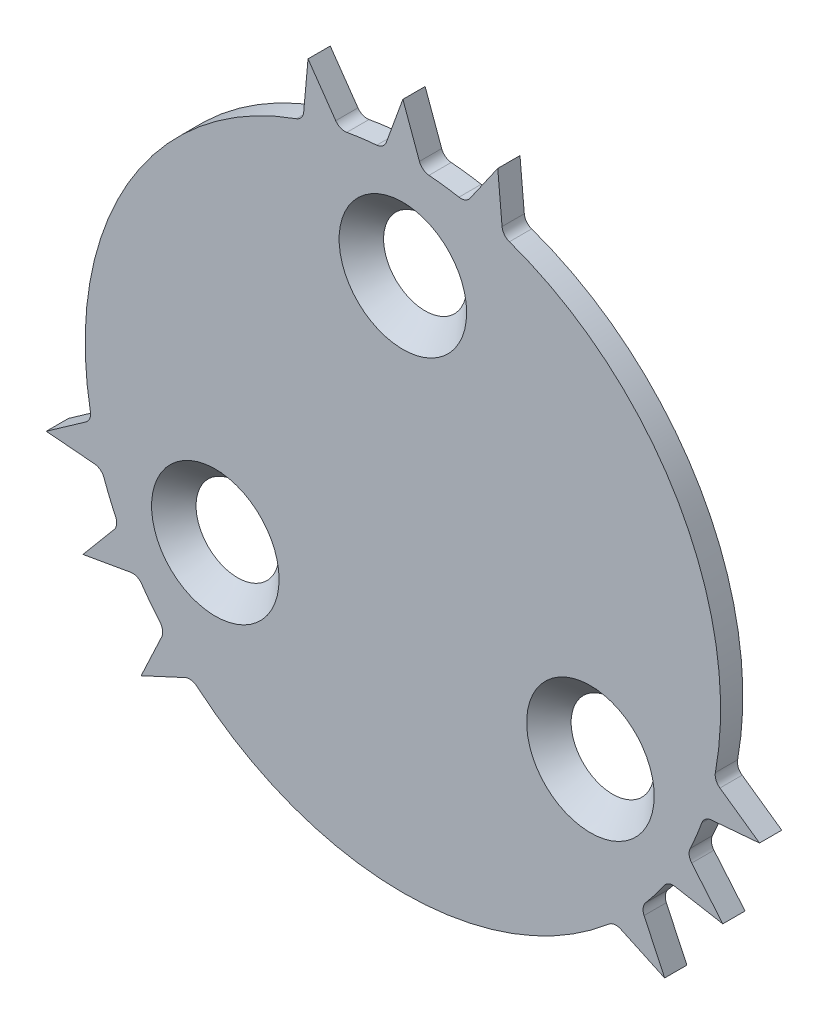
ISO-10303-21;
HEADER;
FILE_DESCRIPTION(('STEP AP214'),'2;1');
FILE_NAME('part.step','',(''),(''),'','','');
FILE_SCHEMA(('AUTOMOTIVE_DESIGN { 1 0 10303 214 1 1 1 1 }'));
ENDSEC;
DATA;
#1=APPLICATION_CONTEXT('core data for automotive mechanical design processes');
#2=APPLICATION_PROTOCOL_DEFINITION('international standard','automotive_design',2000,#1);
#3=PRODUCT_CONTEXT('',#1,'mechanical');
#4=PRODUCT('Part','Part','',(#3));
#5=PRODUCT_RELATED_PRODUCT_CATEGORY('part','',(#4));
#6=PRODUCT_DEFINITION_FORMATION('','',#4);
#7=PRODUCT_DEFINITION_CONTEXT('part definition',#1,'design');
#8=PRODUCT_DEFINITION('design','',#6,#7);
#9=PRODUCT_DEFINITION_SHAPE('','',#8);
#10=(LENGTH_UNIT() NAMED_UNIT(*) SI_UNIT(.MILLI.,.METRE.));
#11=(NAMED_UNIT(*) PLANE_ANGLE_UNIT() SI_UNIT($,.RADIAN.));
#12=(NAMED_UNIT(*) SI_UNIT($,.STERADIAN.) SOLID_ANGLE_UNIT());
#13=UNCERTAINTY_MEASURE_WITH_UNIT(LENGTH_MEASURE(1.E-05),#10,'distance_accuracy_value','');
#14=(GEOMETRIC_REPRESENTATION_CONTEXT(3) GLOBAL_UNCERTAINTY_ASSIGNED_CONTEXT((#13)) GLOBAL_UNIT_ASSIGNED_CONTEXT((#10,
#11,#12)) REPRESENTATION_CONTEXT('',''));
#15=CARTESIAN_POINT('',(0.,0.,0.));
#16=DIRECTION('',(0.,0.,1.));
#17=DIRECTION('',(1.,0.,0.));
#18=AXIS2_PLACEMENT_3D('',#15,#16,#17);
#19=CARTESIAN_POINT('',(0.,0.,2.));
#20=DIRECTION('',(0.,0.,-1.));
#21=DIRECTION('',(-1.,0.,0.));
#22=AXIS2_PLACEMENT_3D('',#19,#20,#21);
#23=CYLINDRICAL_SURFACE('',#22,28.58);
#24=DIRECTION('',(0.,0.,1.));
#25=VECTOR('',#24,1.);
#26=CARTESIAN_POINT('',(-26.8852523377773,-9.6953394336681,0.));
#27=LINE('',#26,#25);
#28=CARTESIAN_POINT('',(-26.8852523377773,-9.6953394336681,0.));
#29=VERTEX_POINT('',#28);
#30=CARTESIAN_POINT('',(-26.8852523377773,-9.69533943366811,2.));
#31=VERTEX_POINT('',#30);
#32=EDGE_CURVE('E370',#29,#31,#27,.T.);
#33=ORIENTED_EDGE('',*,*,#32,.F.);
#34=CARTESIAN_POINT('',(0.,0.,0.));
#35=DIRECTION('',(0.,0.,1.));
#36=DIRECTION('',(1.,0.,0.));
#37=AXIS2_PLACEMENT_3D('',#34,#35,#36);
#38=CIRCLE('',#37,28.58);
#39=CARTESIAN_POINT('',(-25.8408701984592,-12.2092517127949,0.));
#40=VERTEX_POINT('',#39);
#41=EDGE_CURVE('E652',#29,#40,#38,.T.);
#42=ORIENTED_EDGE('',*,*,#41,.T.);
#43=DIRECTION('',(0.,0.,1.));
#44=VECTOR('',#43,1.);
#45=CARTESIAN_POINT('',(-25.8408701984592,-12.2092517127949,0.));
#46=LINE('',#45,#44);
#47=CARTESIAN_POINT('',(-25.8408701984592,-12.2092517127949,2.));
#48=VERTEX_POINT('',#47);
#49=EDGE_CURVE('E396',#40,#48,#46,.T.);
#50=ORIENTED_EDGE('',*,*,#49,.T.);
#51=CARTESIAN_POINT('',(0.,0.,2.));
#52=DIRECTION('',(0.,0.,1.));
#53=DIRECTION('',(1.,0.,0.));
#54=AXIS2_PLACEMENT_3D('',#51,#52,#53);
#55=CIRCLE('',#54,28.58);
#56=EDGE_CURVE('E44',#31,#48,#55,.T.);
#57=ORIENTED_EDGE('',*,*,#56,.F.);
#58=EDGE_LOOP('',(#33,#42,#50,#57));
#59=FACE_BOUND('',#58,.T.);
#60=ADVANCED_FACE('F35',(#59),#23,.T.);
#61=DIRECTION('',(0.,0.,1.));
#62=VECTOR('',#61,1.);
#63=CARTESIAN_POINT('',(-23.4939572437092,-16.2742241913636,0.));
#64=LINE('',#63,#62);
#65=CARTESIAN_POINT('',(-23.4939572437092,-16.2742241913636,0.));
#66=VERTEX_POINT('',#65);
#67=CARTESIAN_POINT('',(-23.4939572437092,-16.2742241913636,2.));
#68=VERTEX_POINT('',#67);
#69=EDGE_CURVE('E399',#66,#68,#64,.T.);
#70=ORIENTED_EDGE('',*,*,#69,.F.);
#71=CARTESIAN_POINT('',(-21.8390364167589,-18.4356417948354,0.));
#72=VERTEX_POINT('',#71);
#73=EDGE_CURVE('E656',#66,#72,#38,.T.);
#74=ORIENTED_EDGE('',*,*,#73,.T.);
#75=DIRECTION('',(0.,0.,1.));
#76=VECTOR('',#75,1.);
#77=CARTESIAN_POINT('',(-21.8390364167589,-18.4356417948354,0.));
#78=LINE('',#77,#76);
#79=CARTESIAN_POINT('',(-21.8390364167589,-18.4356417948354,2.));
#80=VERTEX_POINT('',#79);
#81=EDGE_CURVE('E497',#72,#80,#78,.T.);
#82=ORIENTED_EDGE('',*,*,#81,.T.);
#83=EDGE_CURVE('E699',#68,#80,#55,.T.);
#84=ORIENTED_EDGE('',*,*,#83,.F.);
#85=EDGE_LOOP('',(#70,#74,#82,#84));
#86=FACE_BOUND('',#85,.T.);
#87=ADVANCED_FACE('F726',(#86),#23,.T.);
#88=DIRECTION('',(0.,0.,1.));
#89=VECTOR('',#88,1.);
#90=CARTESIAN_POINT('',(21.8390364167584,-18.435641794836,0.));
#91=LINE('',#90,#89);
#92=CARTESIAN_POINT('',(21.8390364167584,-18.435641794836,0.));
#93=VERTEX_POINT('',#92);
#94=CARTESIAN_POINT('',(21.8390364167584,-18.435641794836,2.));
#95=VERTEX_POINT('',#94);
#96=EDGE_CURVE('E432',#93,#95,#91,.T.);
#97=ORIENTED_EDGE('',*,*,#96,.F.);
#98=CARTESIAN_POINT('',(23.4939572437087,-16.2742241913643,0.));
#99=VERTEX_POINT('',#98);
#100=EDGE_CURVE('E671',#93,#99,#38,.T.);
#101=ORIENTED_EDGE('',*,*,#100,.T.);
#102=DIRECTION('',(0.,0.,1.));
#103=VECTOR('',#102,1.);
#104=CARTESIAN_POINT('',(23.4939572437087,-16.2742241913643,0.));
#105=LINE('',#104,#103);
#106=CARTESIAN_POINT('',(23.4939572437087,-16.2742241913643,2.));
#107=VERTEX_POINT('',#106);
#108=EDGE_CURVE('E463',#99,#107,#105,.T.);
#109=ORIENTED_EDGE('',*,*,#108,.T.);
#110=EDGE_CURVE('E695',#95,#107,#55,.T.);
#111=ORIENTED_EDGE('',*,*,#110,.F.);
#112=EDGE_LOOP('',(#97,#101,#109,#111));
#113=FACE_BOUND('',#112,.T.);
#114=ADVANCED_FACE('F679',(#113),#23,.T.);
#115=DIRECTION('',(0.,0.,1.));
#116=VECTOR('',#115,1.);
#117=CARTESIAN_POINT('',(25.8408701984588,-12.2092517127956,0.));
#118=LINE('',#117,#116);
#119=CARTESIAN_POINT('',(25.8408701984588,-12.2092517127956,0.));
#120=VERTEX_POINT('',#119);
#121=CARTESIAN_POINT('',(25.8408701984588,-12.2092517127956,2.));
#122=VERTEX_POINT('',#121);
#123=EDGE_CURVE('E466',#120,#122,#118,.T.);
#124=ORIENTED_EDGE('',*,*,#123,.F.);
#125=CARTESIAN_POINT('',(26.885252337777,-9.69533943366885,0.));
#126=VERTEX_POINT('',#125);
#127=EDGE_CURVE('E665',#120,#126,#38,.T.);
#128=ORIENTED_EDGE('',*,*,#127,.T.);
#129=DIRECTION('',(0.,0.,1.));
#130=VECTOR('',#129,1.);
#131=CARTESIAN_POINT('',(26.885252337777,-9.69533943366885,0.));
#132=LINE('',#131,#130);
#133=CARTESIAN_POINT('',(26.885252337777,-9.69533943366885,2.));
#134=VERTEX_POINT('',#133);
#135=EDGE_CURVE('E531',#126,#134,#132,.T.);
#136=ORIENTED_EDGE('',*,*,#135,.T.);
#137=EDGE_CURVE('E698',#122,#134,#55,.T.);
#138=ORIENTED_EDGE('',*,*,#137,.F.);
#139=EDGE_LOOP('',(#124,#128,#136,#138));
#140=FACE_BOUND('',#139,.T.);
#141=ADVANCED_FACE('F837',(#140),#23,.T.);
#142=CARTESIAN_POINT('',(-18.5269589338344,-21.7616220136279,0.));
#143=VERTEX_POINT('',#142);
#144=CARTESIAN_POINT('',(18.5269589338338,-21.7616220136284,0.));
#145=VERTEX_POINT('',#144);
#146=EDGE_CURVE('E666',#143,#145,#38,.T.);
#147=ORIENTED_EDGE('',*,*,#146,.T.);
#148=DIRECTION('',(0.,0.,1.));
#149=VECTOR('',#148,1.);
#150=CARTESIAN_POINT('',(18.5269589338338,-21.7616220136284,0.));
#151=LINE('',#150,#149);
#152=CARTESIAN_POINT('',(18.5269589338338,-21.7616220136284,2.));
#153=VERTEX_POINT('',#152);
#154=EDGE_CURVE('E429',#145,#153,#151,.T.);
#155=ORIENTED_EDGE('',*,*,#154,.T.);
#156=CARTESIAN_POINT('',(-18.5269589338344,-21.7616220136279,2.));
#157=VERTEX_POINT('',#156);
#158=EDGE_CURVE('E697',#157,#153,#55,.T.);
#159=ORIENTED_EDGE('',*,*,#158,.F.);
#160=DIRECTION('',(0.,0.,1.));
#161=VECTOR('',#160,1.);
#162=CARTESIAN_POINT('',(-18.5269589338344,-21.7616220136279,0.));
#163=LINE('',#162,#161);
#164=EDGE_CURVE('E500',#143,#157,#163,.T.);
#165=ORIENTED_EDGE('',*,*,#164,.F.);
#166=EDGE_LOOP('',(#147,#155,#159,#165));
#167=FACE_BOUND('',#166,.T.);
#168=ADVANCED_FACE('F744',(#167),#23,.T.);
#169=DIRECTION('',(0.,0.,1.));
#170=VECTOR('',#169,1.);
#171=CARTESIAN_POINT('',(28.1095969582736,-5.16400608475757,0.));
#172=LINE('',#171,#170);
#173=CARTESIAN_POINT('',(28.1095969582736,-5.16400608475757,0.));
#174=VERTEX_POINT('',#173);
#175=CARTESIAN_POINT('',(28.1095969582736,-5.16400608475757,2.));
#176=VERTEX_POINT('',#175);
#177=EDGE_CURVE('E534',#174,#176,#172,.T.);
#178=ORIENTED_EDGE('',*,*,#177,.F.);
#179=CARTESIAN_POINT('',(9.58263802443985,26.9256280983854,0.));
#180=VERTEX_POINT('',#179);
#181=EDGE_CURVE('E661',#174,#180,#38,.T.);
#182=ORIENTED_EDGE('',*,*,#181,.T.);
#183=DIRECTION('',(0.,0.,1.));
#184=VECTOR('',#183,1.);
#185=CARTESIAN_POINT('',(9.58263802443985,26.9256280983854,0.));
#186=LINE('',#185,#184);
#187=CARTESIAN_POINT('',(9.58263802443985,26.9256280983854,2.));
#188=VERTEX_POINT('',#187);
#189=EDGE_CURVE('E570',#180,#188,#186,.T.);
#190=ORIENTED_EDGE('',*,*,#189,.T.);
#191=EDGE_CURVE('E701',#176,#188,#55,.T.);
#192=ORIENTED_EDGE('',*,*,#191,.F.);
#193=EDGE_LOOP('',(#178,#182,#190,#192));
#194=FACE_BOUND('',#193,.T.);
#195=ADVANCED_FACE('F783',(#194),#23,.T.);
#196=CARTESIAN_POINT('',(0.,0.,0.));
#197=DIRECTION('',(0.,0.,1.));
#198=DIRECTION('',(1.,0.,0.));
#199=AXIS2_PLACEMENT_3D('',#196,#197,#198);
#200=PLANE('',#199);
#201=CARTESIAN_POINT('',(-16.870174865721,-9.73999999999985,0.));
#202=DIRECTION('',(0.,0.,1.));
#203=DIRECTION('',(1.,0.,0.));
#204=AXIS2_PLACEMENT_3D('',#201,#202,#203);
#205=CIRCLE('',#204,3.735);
#206=CARTESIAN_POINT('',(-13.135174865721,-9.73999999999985,0.));
#207=VERTEX_POINT('',#206);
#208=EDGE_CURVE('E914',#207,#207,#205,.T.);
#209=ORIENTED_EDGE('',*,*,#208,.T.);
#210=EDGE_LOOP('',(#209));
#211=FACE_BOUND('',#210,.T.);
#212=CARTESIAN_POINT('',(16.8701748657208,-9.74000000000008,0.));
#213=DIRECTION('',(0.,0.,1.));
#214=DIRECTION('',(1.,0.,0.));
#215=AXIS2_PLACEMENT_3D('',#212,#213,#214);
#216=CIRCLE('',#215,3.735);
#217=CARTESIAN_POINT('',(20.6051748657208,-9.74000000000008,0.));
#218=VERTEX_POINT('',#217);
#219=EDGE_CURVE('E356',#218,#218,#216,.T.);
#220=ORIENTED_EDGE('',*,*,#219,.T.);
#221=EDGE_LOOP('',(#220));
#222=FACE_BOUND('',#221,.T.);
#223=CARTESIAN_POINT('',(0.,19.48,0.));
#224=DIRECTION('',(0.,0.,1.));
#225=DIRECTION('',(1.,0.,0.));
#226=AXIS2_PLACEMENT_3D('',#223,#224,#225);
#227=CIRCLE('',#226,3.735);
#228=CARTESIAN_POINT('',(3.735,19.48,0.));
#229=VERTEX_POINT('',#228);
#230=EDGE_CURVE('E39',#229,#229,#227,.T.);
#231=ORIENTED_EDGE('',*,*,#230,.T.);
#232=EDGE_LOOP('',(#231));
#233=FACE_BOUND('',#232,.T.);
#234=ORIENTED_EDGE('',*,*,#146,.F.);
#235=CARTESIAN_POINT('',(-19.1752080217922,-22.5230503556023,0.));
#236=DIRECTION('',(0.,0.,-1.));
#237=DIRECTION('',(0.499999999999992,-0.866025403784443,0.));
#238=AXIS2_PLACEMENT_3D('',#235,#236,#237);
#239=CIRCLE('',#238,1.00000000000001);
#240=CARTESIAN_POINT('',(-19.595927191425,-21.6158594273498,0.));
#241=VERTEX_POINT('',#240);
#242=EDGE_CURVE('E479',#241,#143,#239,.T.);
#243=ORIENTED_EDGE('',*,*,#242,.F.);
#244=DIRECTION('',(0.907190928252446,0.420719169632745,0.));
#245=VECTOR('',#244,1.);
#246=CARTESIAN_POINT('',(-23.54631910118,-23.4478945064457,0.));
#247=LINE('',#246,#245);
#248=CARTESIAN_POINT('',(-23.54631910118,-23.4478945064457,0.));
#249=VERTEX_POINT('',#248);
#250=EDGE_CURVE('E475',#249,#241,#247,.T.);
#251=ORIENTED_EDGE('',*,*,#250,.F.);
#252=DIRECTION('',(-0.424515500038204,-0.905420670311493,0.));
#253=VECTOR('',#252,1.);
#254=CARTESIAN_POINT('',(-21.6977527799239,-19.5052112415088,0.));
#255=LINE('',#254,#253);
#256=CARTESIAN_POINT('',(-21.6977527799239,-19.5052112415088,0.));
#257=VERTEX_POINT('',#256);
#258=EDGE_CURVE('E472',#257,#249,#255,.T.);
#259=ORIENTED_EDGE('',*,*,#258,.F.);
#260=CARTESIAN_POINT('',(-22.6031734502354,-19.0806957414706,0.));
#261=DIRECTION('',(0.,0.,-1.));
#262=DIRECTION('',(-0.499999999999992,0.866025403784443,0.));
#263=AXIS2_PLACEMENT_3D('',#260,#261,#262);
#264=CIRCLE('',#263,1.00000000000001);
#265=EDGE_CURVE('E481',#72,#257,#264,.T.);
#266=ORIENTED_EDGE('',*,*,#265,.F.);
#267=ORIENTED_EDGE('',*,*,#73,.F.);
#268=CARTESIAN_POINT('',(-24.3159991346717,-16.8436512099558,0.));
#269=DIRECTION('',(0.,0.,-1.));
#270=DIRECTION('',(0.260841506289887,-0.965381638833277,0.));
#271=AXIS2_PLACEMENT_3D('',#268,#269,#270);
#272=CIRCLE('',#271,1.00000000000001);
#273=CARTESIAN_POINT('',(-24.4896473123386,-15.8588434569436,0.));
#274=VERTEX_POINT('',#273);
#275=EDGE_CURVE('E380',#274,#66,#272,.T.);
#276=ORIENTED_EDGE('',*,*,#275,.F.);
#277=DIRECTION('',(0.98480775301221,0.173648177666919,0.));
#278=VECTOR('',#277,1.);
#279=CARTESIAN_POINT('',(-28.7780241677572,-16.6149999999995,0.));
#280=LINE('',#279,#278);
#281=CARTESIAN_POINT('',(-28.7780241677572,-16.6149999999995,0.));
#282=VERTEX_POINT('',#281);
#283=EDGE_CURVE('E376',#282,#274,#280,.T.);
#284=ORIENTED_EDGE('',*,*,#283,.F.);
#285=DIRECTION('',(-0.642787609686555,-0.766044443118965,0.));
#286=VECTOR('',#285,1.);
#287=CARTESIAN_POINT('',(-25.9789849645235,-13.2792349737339,0.));
#288=LINE('',#287,#286);
#289=CARTESIAN_POINT('',(-25.9789849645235,-13.2792349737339,0.));
#290=VERTEX_POINT('',#289);
#291=EDGE_CURVE('E373',#290,#282,#288,.T.);
#292=ORIENTED_EDGE('',*,*,#291,.F.);
#293=CARTESIAN_POINT('',(-26.7450294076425,-12.6364473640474,0.));
#294=DIRECTION('',(0.,0.,-1.));
#295=DIRECTION('',(-0.260841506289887,0.965381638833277,0.));
#296=AXIS2_PLACEMENT_3D('',#293,#294,#295);
#297=CIRCLE('',#296,1.00000000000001);
#298=EDGE_CURVE('E382',#40,#290,#297,.T.);
#299=ORIENTED_EDGE('',*,*,#298,.F.);
#300=ORIENTED_EDGE('',*,*,#41,.F.);
#301=CARTESIAN_POINT('',(-27.8259539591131,-10.0345745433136,0.));
#302=DIRECTION('',(0.,0.,-1.));
#303=DIRECTION('',(0.00418877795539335,-0.999991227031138,0.));
#304=AXIS2_PLACEMENT_3D('',#301,#302,#303);
#305=CIRCLE('',#304,1.00000000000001);
#306=CARTESIAN_POINT('',(-27.7408848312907,-9.0381994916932,0.));
#307=VERTEX_POINT('',#306);
#308=EDGE_CURVE('E347',#307,#29,#305,.T.);
#309=ORIENTED_EDGE('',*,*,#308,.F.);
#310=DIRECTION('',(0.996375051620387,-0.0850691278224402,0.));
#311=VECTOR('',#310,1.);
#312=CARTESIAN_POINT('',(-32.0796318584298,-8.66776325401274,0.));
#313=LINE('',#312,#311);
#314=CARTESIAN_POINT('',(-32.0796318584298,-8.66776325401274,0.));
#315=VERTEX_POINT('',#314);
#316=EDGE_CURVE('E329',#315,#307,#313,.T.);
#317=ORIENTED_EDGE('',*,*,#316,.F.);
#318=DIRECTION('',(-0.817948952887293,-0.575290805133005,0.));
#319=VECTOR('',#318,1.);
#320=CARTESIAN_POINT('',(-28.517846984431,-6.16264104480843,0.));
#321=LINE('',#320,#319);
#322=CARTESIAN_POINT('',(-28.517846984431,-6.16264104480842,0.));
#323=VERTEX_POINT('',#322);
#324=EDGE_CURVE('E344',#323,#315,#321,.T.);
#325=ORIENTED_EDGE('',*,*,#324,.F.);
#326=CARTESIAN_POINT('',(-29.093137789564,-5.34469209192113,0.));
#327=DIRECTION('',(0.,0.,-1.));
#328=DIRECTION('',(-0.00418877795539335,0.999991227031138,0.));
#329=AXIS2_PLACEMENT_3D('',#326,#327,#328);
#330=CIRCLE('',#329,1.00000000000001);
#331=CARTESIAN_POINT('',(-28.1095969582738,-5.16400608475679,0.));
#332=VERTEX_POINT('',#331);
#333=EDGE_CURVE('E336',#332,#323,#330,.T.);
#334=ORIENTED_EDGE('',*,*,#333,.F.);
#335=CARTESIAN_POINT('',(-9.58263802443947,26.9256280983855,0.));
#336=VERTEX_POINT('',#335);
#337=EDGE_CURVE('E650',#336,#332,#38,.T.);
#338=ORIENTED_EDGE('',*,*,#337,.F.);
#339=CARTESIAN_POINT('',(-9.91792976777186,27.8677424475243,0.));
#340=DIRECTION('',(0.,0.,-1.));
#341=DIRECTION('',(-1.,0.,0.));
#342=AXIS2_PLACEMENT_3D('',#339,#340,#341);
#343=CIRCLE('',#342,1.00000000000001);
#344=CARTESIAN_POINT('',(-8.92191979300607,27.7785004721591,0.));
#345=VERTEX_POINT('',#344);
#346=EDGE_CURVE('E622',#345,#336,#343,.T.);
#347=ORIENTED_EDGE('',*,*,#346,.F.);
#348=DIRECTION('',(-0.0892419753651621,-0.996009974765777,0.));
#349=VECTOR('',#348,1.);
#350=CARTESIAN_POINT('',(-8.53331275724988,32.1156577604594,0.));
#351=LINE('',#350,#349);
#352=CARTESIAN_POINT('',(-8.53331275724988,32.1156577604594,0.));
#353=VERTEX_POINT('',#352);
#354=EDGE_CURVE('E618',#353,#345,#351,.T.);
#355=ORIENTED_EDGE('',*,*,#354,.F.);
#356=DIRECTION('',(-0.571859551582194,0.82035154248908,0.));
#357=VECTOR('',#356,1.);
#358=CARTESIAN_POINT('',(-6.04313205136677,28.5434107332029,0.));
#359=LINE('',#358,#357);
#360=CARTESIAN_POINT('',(-6.04313205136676,28.5434107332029,0.));
#361=VERTEX_POINT('',#360);
#362=EDGE_CURVE('E615',#361,#353,#359,.T.);
#363=ORIENTED_EDGE('',*,*,#362,.F.);
#364=CARTESIAN_POINT('',(-5.22278050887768,29.1152702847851,0.));
#365=DIRECTION('',(0.,0.,-1.));
#366=DIRECTION('',(1.,0.,0.));
#367=AXIS2_PLACEMENT_3D('',#364,#365,#366);
#368=CIRCLE('',#367,1.00000000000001);
#369=CARTESIAN_POINT('',(-5.04621592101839,28.1309812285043,0.));
#370=VERTEX_POINT('',#369);
#371=EDGE_CURVE('E625',#370,#361,#368,.T.);
#372=ORIENTED_EDGE('',*,*,#371,.F.);
#373=CARTESIAN_POINT('',(-2.34691295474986,28.4834759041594,0.));
#374=VERTEX_POINT('',#373);
#375=EDGE_CURVE('E641',#374,#370,#38,.T.);
#376=ORIENTED_EDGE('',*,*,#375,.F.);
#377=CARTESIAN_POINT('',(-2.42903027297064,29.480098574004,0.));
#378=DIRECTION('',(0.,0.,-1.));
#379=DIRECTION('',(-0.966465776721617,0.256795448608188,0.));
#380=AXIS2_PLACEMENT_3D('',#377,#378,#379);
#381=CIRCLE('',#380,1.00000000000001);
#382=CARTESIAN_POINT('',(-1.48933765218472,29.1380784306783,0.));
#383=VERTEX_POINT('',#382);
#384=EDGE_CURVE('E586',#383,#374,#381,.T.);
#385=ORIENTED_EDGE('',*,*,#384,.F.);
#386=DIRECTION('',(-0.342020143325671,-0.939692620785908,0.));
#387=VECTOR('',#386,1.);
#388=CARTESIAN_POINT('',(2.28983498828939E-13,33.23,0.));
#389=LINE('',#388,#387);
#390=CARTESIAN_POINT('',(2.28983498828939E-13,33.23,0.));
#391=VERTEX_POINT('',#390);
#392=EDGE_CURVE('E582',#391,#383,#389,.T.);
#393=ORIENTED_EDGE('',*,*,#392,.F.);
#394=DIRECTION('',(-0.342020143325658,0.939692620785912,0.));
#395=VECTOR('',#394,1.);
#396=CARTESIAN_POINT('',(1.48933765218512,29.1380784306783,0.));
#397=LINE('',#396,#395);
#398=CARTESIAN_POINT('',(1.48933765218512,29.1380784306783,0.));
#399=VERTEX_POINT('',#398);
#400=EDGE_CURVE('E579',#399,#391,#397,.T.);
#401=ORIENTED_EDGE('',*,*,#400,.F.);
#402=CARTESIAN_POINT('',(2.42903027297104,29.480098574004,0.));
#403=DIRECTION('',(0.,0.,-1.));
#404=DIRECTION('',(0.966465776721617,-0.256795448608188,0.));
#405=AXIS2_PLACEMENT_3D('',#402,#403,#404);
#406=CIRCLE('',#405,1.00000000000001);
#407=CARTESIAN_POINT('',(2.34691295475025,28.4834759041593,0.));
#408=VERTEX_POINT('',#407);
#409=EDGE_CURVE('E589',#408,#399,#406,.T.);
#410=ORIENTED_EDGE('',*,*,#409,.F.);
#411=CARTESIAN_POINT('',(5.04621592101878,28.1309812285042,0.));
#412=VERTEX_POINT('',#411);
#413=EDGE_CURVE('E657',#412,#408,#38,.T.);
#414=ORIENTED_EDGE('',*,*,#413,.F.);
#415=CARTESIAN_POINT('',(5.22278050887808,29.115270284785,0.));
#416=DIRECTION('',(0.,0.,-1.));
#417=DIRECTION('',(-0.868112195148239,0.496368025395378,0.));
#418=AXIS2_PLACEMENT_3D('',#415,#416,#417);
#419=CIRCLE('',#418,1.00000000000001);
#420=CARTESIAN_POINT('',(6.04313205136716,28.5434107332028,0.));
#421=VERTEX_POINT('',#420);
#422=EDGE_CURVE('E549',#421,#412,#419,.T.);
#423=ORIENTED_EDGE('',*,*,#422,.F.);
#424=DIRECTION('',(-0.571859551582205,-0.820351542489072,0.));
#425=VECTOR('',#424,1.);
#426=CARTESIAN_POINT('',(8.53331275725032,32.1156577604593,0.));
#427=LINE('',#426,#425);
#428=CARTESIAN_POINT('',(8.53331275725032,32.1156577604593,0.));
#429=VERTEX_POINT('',#428);
#430=EDGE_CURVE('E545',#429,#421,#427,.T.);
#431=ORIENTED_EDGE('',*,*,#430,.F.);
#432=DIRECTION('',(-0.0892419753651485,0.996009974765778,0.));
#433=VECTOR('',#432,1.);
#434=CARTESIAN_POINT('',(8.92191979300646,27.778500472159,0.));
#435=LINE('',#434,#433);
#436=CARTESIAN_POINT('',(8.92191979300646,27.778500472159,0.));
#437=VERTEX_POINT('',#436);
#438=EDGE_CURVE('E542',#437,#429,#435,.T.);
#439=ORIENTED_EDGE('',*,*,#438,.F.);
#440=CARTESIAN_POINT('',(9.91792976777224,27.8677424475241,0.));
#441=DIRECTION('',(0.,0.,-1.));
#442=DIRECTION('',(0.868112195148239,-0.496368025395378,0.));
#443=AXIS2_PLACEMENT_3D('',#440,#441,#442);
#444=CIRCLE('',#443,1.00000000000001);
#445=EDGE_CURVE('E552',#180,#437,#444,.T.);
#446=ORIENTED_EDGE('',*,*,#445,.F.);
#447=ORIENTED_EDGE('',*,*,#181,.F.);
#448=CARTESIAN_POINT('',(29.0931377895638,-5.34469209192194,0.));
#449=DIRECTION('',(0.,0.,-1.));
#450=DIRECTION('',(0.500000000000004,0.866025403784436,0.));
#451=AXIS2_PLACEMENT_3D('',#448,#449,#450);
#452=CIRCLE('',#451,1.00000000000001);
#453=CARTESIAN_POINT('',(28.5178469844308,-6.16264104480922,0.));
#454=VERTEX_POINT('',#453);
#455=EDGE_CURVE('E513',#454,#174,#452,.T.);
#456=ORIENTED_EDGE('',*,*,#455,.F.);
#457=DIRECTION('',(-0.817948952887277,0.575290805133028,0.));
#458=VECTOR('',#457,1.);
#459=CARTESIAN_POINT('',(32.0796318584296,-8.66776325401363,0.));
#460=LINE('',#459,#458);
#461=CARTESIAN_POINT('',(32.0796318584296,-8.66776325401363,0.));
#462=VERTEX_POINT('',#461);
#463=EDGE_CURVE('E509',#462,#454,#460,.T.);
#464=ORIENTED_EDGE('',*,*,#463,.F.);
#465=DIRECTION('',(0.99637505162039,0.0850691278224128,0.));
#466=VECTOR('',#465,1.);
#467=CARTESIAN_POINT('',(27.7408848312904,-9.03819949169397,0.));
#468=LINE('',#467,#466);
#469=CARTESIAN_POINT('',(27.7408848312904,-9.03819949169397,0.));
#470=VERTEX_POINT('',#469);
#471=EDGE_CURVE('E506',#470,#462,#468,.T.);
#472=ORIENTED_EDGE('',*,*,#471,.F.);
#473=CARTESIAN_POINT('',(27.8259539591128,-10.0345745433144,0.));
#474=DIRECTION('',(0.,0.,-1.));
#475=DIRECTION('',(-0.500000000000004,-0.866025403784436,0.));
#476=AXIS2_PLACEMENT_3D('',#473,#474,#475);
#477=CIRCLE('',#476,1.00000000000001);
#478=EDGE_CURVE('E515',#126,#470,#477,.T.);
#479=ORIENTED_EDGE('',*,*,#478,.F.);
#480=ORIENTED_EDGE('',*,*,#127,.F.);
#481=CARTESIAN_POINT('',(26.7450294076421,-12.6364473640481,0.));
#482=DIRECTION('',(0.,0.,-1.));
#483=DIRECTION('',(0.705624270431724,0.708586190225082,0.));
#484=AXIS2_PLACEMENT_3D('',#481,#482,#483);
#485=CIRCLE('',#484,1.00000000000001);
#486=CARTESIAN_POINT('',(25.9789849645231,-13.2792349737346,0.));
#487=VERTEX_POINT('',#486);
#488=EDGE_CURVE('E445',#487,#120,#485,.T.);
#489=ORIENTED_EDGE('',*,*,#488,.F.);
#490=DIRECTION('',(-0.642787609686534,0.766044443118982,0.));
#491=VECTOR('',#490,1.);
#492=CARTESIAN_POINT('',(28.7780241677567,-16.6150000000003,0.));
#493=LINE('',#492,#491);
#494=CARTESIAN_POINT('',(28.7780241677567,-16.6150000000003,0.));
#495=VERTEX_POINT('',#494);
#496=EDGE_CURVE('E441',#495,#487,#493,.T.);
#497=ORIENTED_EDGE('',*,*,#496,.F.);
#498=DIRECTION('',(0.984807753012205,-0.173648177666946,0.));
#499=VECTOR('',#498,1.);
#500=CARTESIAN_POINT('',(24.4896473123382,-15.8588434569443,0.));
#501=LINE('',#500,#499);
#502=CARTESIAN_POINT('',(24.4896473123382,-15.8588434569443,0.));
#503=VERTEX_POINT('',#502);
#504=EDGE_CURVE('E438',#503,#495,#501,.T.);
#505=ORIENTED_EDGE('',*,*,#504,.F.);
#506=CARTESIAN_POINT('',(24.3159991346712,-16.8436512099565,0.));
#507=DIRECTION('',(0.,0.,-1.));
#508=DIRECTION('',(-0.705624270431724,-0.708586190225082,0.));
#509=AXIS2_PLACEMENT_3D('',#506,#507,#508);
#510=CIRCLE('',#509,1.00000000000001);
#511=EDGE_CURVE('E447',#99,#503,#510,.T.);
#512=ORIENTED_EDGE('',*,*,#511,.F.);
#513=ORIENTED_EDGE('',*,*,#100,.F.);
#514=CARTESIAN_POINT('',(22.6031734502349,-19.0806957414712,0.));
#515=DIRECTION('',(0.,0.,-1.));
#516=DIRECTION('',(0.863923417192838,0.503623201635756,0.));
#517=AXIS2_PLACEMENT_3D('',#514,#515,#516);
#518=CIRCLE('',#517,1.00000000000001);
#519=CARTESIAN_POINT('',(21.6977527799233,-19.5052112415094,0.));
#520=VERTEX_POINT('',#519);
#521=EDGE_CURVE('E411',#520,#93,#518,.T.);
#522=ORIENTED_EDGE('',*,*,#521,.F.);
#523=DIRECTION('',(-0.424515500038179,0.905420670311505,0.));
#524=VECTOR('',#523,1.);
#525=CARTESIAN_POINT('',(23.5463191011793,-23.4478945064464,0.));
#526=LINE('',#525,#524);
#527=CARTESIAN_POINT('',(23.5463191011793,-23.4478945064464,0.));
#528=VERTEX_POINT('',#527);
#529=EDGE_CURVE('E407',#528,#520,#526,.T.);
#530=ORIENTED_EDGE('',*,*,#529,.F.);
#531=DIRECTION('',(0.907190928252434,-0.42071916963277,0.));
#532=VECTOR('',#531,1.);
#533=CARTESIAN_POINT('',(19.5959271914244,-21.6158594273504,0.));
#534=LINE('',#533,#532);
#535=CARTESIAN_POINT('',(19.5959271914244,-21.6158594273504,0.));
#536=VERTEX_POINT('',#535);
#537=EDGE_CURVE('E404',#536,#528,#534,.T.);
#538=ORIENTED_EDGE('',*,*,#537,.F.);
#539=CARTESIAN_POINT('',(19.1752080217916,-22.5230503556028,0.));
#540=DIRECTION('',(0.,0.,-1.));
#541=DIRECTION('',(-0.863923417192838,-0.503623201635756,0.));
#542=AXIS2_PLACEMENT_3D('',#539,#540,#541);
#543=CIRCLE('',#542,1.00000000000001);
#544=EDGE_CURVE('E413',#145,#536,#543,.T.);
#545=ORIENTED_EDGE('',*,*,#544,.F.);
#546=EDGE_LOOP('',(#234,#243,#251,#259,#266,#267,#276,#284,#292,#299,#300,#309,#317,#325,#334,
#338,#347,#355,#363,#372,#376,#385,#393,#401,#410,#414,#423,#431,#439,#446,#447,#456,#464,#472,
#479,#480,#489,#497,#505,#512,#513,#522,#530,#538,#545));
#547=FACE_BOUND('',#546,.T.);
#548=ADVANCED_FACE('F342',(#211,#222,#233,#547),#200,.F.);
#549=DIRECTION('',(0.,0.,1.));
#550=VECTOR('',#549,1.);
#551=CARTESIAN_POINT('',(5.04621592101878,28.1309812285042,0.));
#552=LINE('',#551,#550);
#553=CARTESIAN_POINT('',(5.04621592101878,28.1309812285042,2.));
#554=VERTEX_POINT('',#553);
#555=EDGE_CURVE('E573',#412,#554,#552,.T.);
#556=ORIENTED_EDGE('',*,*,#555,.F.);
#557=ORIENTED_EDGE('',*,*,#413,.T.);
#558=DIRECTION('',(0.,0.,1.));
#559=VECTOR('',#558,1.);
#560=CARTESIAN_POINT('',(2.34691295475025,28.4834759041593,0.));
#561=LINE('',#560,#559);
#562=CARTESIAN_POINT('',(2.34691295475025,28.4834759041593,2.));
#563=VERTEX_POINT('',#562);
#564=EDGE_CURVE('E606',#408,#563,#561,.T.);
#565=ORIENTED_EDGE('',*,*,#564,.T.);
#566=EDGE_CURVE('E655',#554,#563,#55,.T.);
#567=ORIENTED_EDGE('',*,*,#566,.F.);
#568=EDGE_LOOP('',(#556,#557,#565,#567));
#569=FACE_BOUND('',#568,.T.);
#570=ADVANCED_FACE('F779',(#569),#23,.T.);
#571=DIRECTION('',(0.,0.,1.));
#572=VECTOR('',#571,1.);
#573=CARTESIAN_POINT('',(-2.34691295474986,28.4834759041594,0.));
#574=LINE('',#573,#572);
#575=CARTESIAN_POINT('',(-2.34691295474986,28.4834759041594,2.));
#576=VERTEX_POINT('',#575);
#577=EDGE_CURVE('E609',#374,#576,#574,.T.);
#578=ORIENTED_EDGE('',*,*,#577,.F.);
#579=ORIENTED_EDGE('',*,*,#375,.T.);
#580=DIRECTION('',(0.,0.,1.));
#581=VECTOR('',#580,1.);
#582=CARTESIAN_POINT('',(-5.04621592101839,28.1309812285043,0.));
#583=LINE('',#582,#581);
#584=CARTESIAN_POINT('',(-5.04621592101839,28.1309812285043,2.));
#585=VERTEX_POINT('',#584);
#586=EDGE_CURVE('E642',#370,#585,#583,.T.);
#587=ORIENTED_EDGE('',*,*,#586,.T.);
#588=EDGE_CURVE('E46',#576,#585,#55,.T.);
#589=ORIENTED_EDGE('',*,*,#588,.F.);
#590=EDGE_LOOP('',(#578,#579,#587,#589));
#591=FACE_BOUND('',#590,.T.);
#592=ADVANCED_FACE('F771',(#591),#23,.T.);
#593=ORIENTED_EDGE('',*,*,#337,.T.);
#594=DIRECTION('',(0.,0.,1.));
#595=VECTOR('',#594,1.);
#596=CARTESIAN_POINT('',(-28.1095969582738,-5.16400608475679,0.));
#597=LINE('',#596,#595);
#598=CARTESIAN_POINT('',(-28.1095969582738,-5.16400608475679,2.));
#599=VERTEX_POINT('',#598);
#600=EDGE_CURVE('E367',#332,#599,#597,.T.);
#601=ORIENTED_EDGE('',*,*,#600,.T.);
#602=CARTESIAN_POINT('',(-9.58263802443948,26.9256280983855,2.));
#603=VERTEX_POINT('',#602);
#604=EDGE_CURVE('E11',#603,#599,#55,.T.);
#605=ORIENTED_EDGE('',*,*,#604,.F.);
#606=DIRECTION('',(0.,0.,1.));
#607=VECTOR('',#606,1.);
#608=CARTESIAN_POINT('',(-9.58263802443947,26.9256280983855,0.));
#609=LINE('',#608,#607);
#610=EDGE_CURVE('E645',#336,#603,#609,.T.);
#611=ORIENTED_EDGE('',*,*,#610,.F.);
#612=EDGE_LOOP('',(#593,#601,#605,#611));
#613=FACE_BOUND('',#612,.T.);
#614=ADVANCED_FACE('F37',(#613),#23,.T.);
#615=CARTESIAN_POINT('',(0.,0.,2.));
#616=DIRECTION('',(0.,0.,1.));
#617=DIRECTION('',(1.,0.,0.));
#618=AXIS2_PLACEMENT_3D('',#615,#616,#617);
#619=PLANE('',#618);
#620=CARTESIAN_POINT('',(-16.870174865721,-9.73999999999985,2.));
#621=DIRECTION('',(0.,0.,1.));
#622=DIRECTION('',(1.,0.,0.));
#623=AXIS2_PLACEMENT_3D('',#620,#621,#622);
#624=CIRCLE('',#623,5.735);
#625=CARTESIAN_POINT('',(-11.135174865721,-9.73999999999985,2.));
#626=VERTEX_POINT('',#625);
#627=EDGE_CURVE('E926',#626,#626,#624,.T.);
#628=ORIENTED_EDGE('',*,*,#627,.F.);
#629=EDGE_LOOP('',(#628));
#630=FACE_BOUND('',#629,.T.);
#631=CARTESIAN_POINT('',(16.8701748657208,-9.74000000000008,2.));
#632=DIRECTION('',(0.,0.,1.));
#633=DIRECTION('',(1.,0.,0.));
#634=AXIS2_PLACEMENT_3D('',#631,#632,#633);
#635=CIRCLE('',#634,5.735);
#636=CARTESIAN_POINT('',(22.6051748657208,-9.74000000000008,2.));
#637=VERTEX_POINT('',#636);
#638=EDGE_CURVE('E922',#637,#637,#635,.T.);
#639=ORIENTED_EDGE('',*,*,#638,.F.);
#640=EDGE_LOOP('',(#639));
#641=FACE_BOUND('',#640,.T.);
#642=ORIENTED_EDGE('',*,*,#604,.T.);
#643=CARTESIAN_POINT('',(-29.093137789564,-5.34469209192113,2.));
#644=DIRECTION('',(0.,0.,-1.));
#645=DIRECTION('',(-0.00418877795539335,0.999991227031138,0.));
#646=AXIS2_PLACEMENT_3D('',#643,#644,#645);
#647=CIRCLE('',#646,1.00000000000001);
#648=CARTESIAN_POINT('',(-28.517846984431,-6.16264104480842,2.));
#649=VERTEX_POINT('',#648);
#650=EDGE_CURVE('E351',#599,#649,#647,.T.);
#651=ORIENTED_EDGE('',*,*,#650,.T.);
#652=DIRECTION('',(-0.817948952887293,-0.575290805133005,0.));
#653=VECTOR('',#652,1.);
#654=CARTESIAN_POINT('',(-28.517846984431,-6.16264104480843,2.));
#655=LINE('',#654,#653);
#656=CARTESIAN_POINT('',(-32.0796318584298,-8.66776325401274,2.));
#657=VERTEX_POINT('',#656);
#658=EDGE_CURVE('E361',#649,#657,#655,.T.);
#659=ORIENTED_EDGE('',*,*,#658,.T.);
#660=DIRECTION('',(0.996375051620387,-0.0850691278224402,0.));
#661=VECTOR('',#660,1.);
#662=CARTESIAN_POINT('',(-32.0796318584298,-8.66776325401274,2.));
#663=LINE('',#662,#661);
#664=CARTESIAN_POINT('',(-27.7408848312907,-9.0381994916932,2.));
#665=VERTEX_POINT('',#664);
#666=EDGE_CURVE('E330',#657,#665,#663,.T.);
#667=ORIENTED_EDGE('',*,*,#666,.T.);
#668=CARTESIAN_POINT('',(-27.8259539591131,-10.0345745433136,2.));
#669=DIRECTION('',(0.,0.,-1.));
#670=DIRECTION('',(0.00418877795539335,-0.999991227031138,0.));
#671=AXIS2_PLACEMENT_3D('',#668,#669,#670);
#672=CIRCLE('',#671,1.00000000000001);
#673=EDGE_CURVE('E53',#665,#31,#672,.T.);
#674=ORIENTED_EDGE('',*,*,#673,.T.);
#675=ORIENTED_EDGE('',*,*,#56,.T.);
#676=CARTESIAN_POINT('',(-26.7450294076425,-12.6364473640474,2.));
#677=DIRECTION('',(0.,0.,-1.));
#678=DIRECTION('',(-0.260841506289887,0.965381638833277,0.));
#679=AXIS2_PLACEMENT_3D('',#676,#677,#678);
#680=CIRCLE('',#679,1.00000000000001);
#681=CARTESIAN_POINT('',(-25.9789849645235,-13.2792349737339,2.));
#682=VERTEX_POINT('',#681);
#683=EDGE_CURVE('E377',#48,#682,#680,.T.);
#684=ORIENTED_EDGE('',*,*,#683,.T.);
#685=DIRECTION('',(-0.642787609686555,-0.766044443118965,0.));
#686=VECTOR('',#685,1.);
#687=CARTESIAN_POINT('',(-25.9789849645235,-13.2792349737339,2.));
#688=LINE('',#687,#686);
#689=CARTESIAN_POINT('',(-28.7780241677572,-16.6149999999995,2.));
#690=VERTEX_POINT('',#689);
#691=EDGE_CURVE('E366',#682,#690,#688,.T.);
#692=ORIENTED_EDGE('',*,*,#691,.T.);
#693=DIRECTION('',(0.98480775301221,0.173648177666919,0.));
#694=VECTOR('',#693,1.);
#695=CARTESIAN_POINT('',(-28.7780241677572,-16.6149999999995,2.));
#696=LINE('',#695,#694);
#697=CARTESIAN_POINT('',(-24.4896473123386,-15.8588434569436,2.));
#698=VERTEX_POINT('',#697);
#699=EDGE_CURVE('E388',#690,#698,#696,.T.);
#700=ORIENTED_EDGE('',*,*,#699,.T.);
#701=CARTESIAN_POINT('',(-24.3159991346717,-16.8436512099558,2.));
#702=DIRECTION('',(0.,0.,-1.));
#703=DIRECTION('',(0.260841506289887,-0.965381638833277,0.));
#704=AXIS2_PLACEMENT_3D('',#701,#702,#703);
#705=CIRCLE('',#704,1.00000000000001);
#706=EDGE_CURVE('E60',#698,#68,#705,.T.);
#707=ORIENTED_EDGE('',*,*,#706,.T.);
#708=ORIENTED_EDGE('',*,*,#83,.T.);
#709=CARTESIAN_POINT('',(-22.6031734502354,-19.0806957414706,2.));
#710=DIRECTION('',(0.,0.,-1.));
#711=DIRECTION('',(-0.499999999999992,0.866025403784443,0.));
#712=AXIS2_PLACEMENT_3D('',#709,#710,#711);
#713=CIRCLE('',#712,1.00000000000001);
#714=CARTESIAN_POINT('',(-21.6977527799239,-19.5052112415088,2.));
#715=VERTEX_POINT('',#714);
#716=EDGE_CURVE('E476',#80,#715,#713,.T.);
#717=ORIENTED_EDGE('',*,*,#716,.T.);
#718=DIRECTION('',(-0.424515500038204,-0.905420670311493,0.));
#719=VECTOR('',#718,1.);
#720=CARTESIAN_POINT('',(-21.6977527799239,-19.5052112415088,2.));
#721=LINE('',#720,#719);
#722=CARTESIAN_POINT('',(-23.54631910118,-23.4478945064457,2.));
#723=VERTEX_POINT('',#722);
#724=EDGE_CURVE('E462',#715,#723,#721,.T.);
#725=ORIENTED_EDGE('',*,*,#724,.T.);
#726=DIRECTION('',(0.907190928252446,0.420719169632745,0.));
#727=VECTOR('',#726,1.);
#728=CARTESIAN_POINT('',(-23.54631910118,-23.4478945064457,2.));
#729=LINE('',#728,#727);
#730=CARTESIAN_POINT('',(-19.595927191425,-21.6158594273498,2.));
#731=VERTEX_POINT('',#730);
#732=EDGE_CURVE('E487',#723,#731,#729,.T.);
#733=ORIENTED_EDGE('',*,*,#732,.T.);
#734=CARTESIAN_POINT('',(-19.1752080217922,-22.5230503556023,2.));
#735=DIRECTION('',(0.,0.,-1.));
#736=DIRECTION('',(0.499999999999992,-0.866025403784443,0.));
#737=AXIS2_PLACEMENT_3D('',#734,#735,#736);
#738=CIRCLE('',#737,1.00000000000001);
#739=EDGE_CURVE('E490',#731,#157,#738,.T.);
#740=ORIENTED_EDGE('',*,*,#739,.T.);
#741=ORIENTED_EDGE('',*,*,#158,.T.);
#742=CARTESIAN_POINT('',(19.1752080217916,-22.5230503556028,2.));
#743=DIRECTION('',(0.,0.,-1.));
#744=DIRECTION('',(-0.863923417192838,-0.503623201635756,0.));
#745=AXIS2_PLACEMENT_3D('',#742,#743,#744);
#746=CIRCLE('',#745,1.00000000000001);
#747=CARTESIAN_POINT('',(19.5959271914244,-21.6158594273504,2.));
#748=VERTEX_POINT('',#747);
#749=EDGE_CURVE('E408',#153,#748,#746,.T.);
#750=ORIENTED_EDGE('',*,*,#749,.T.);
#751=DIRECTION('',(0.907190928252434,-0.42071916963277,0.));
#752=VECTOR('',#751,1.);
#753=CARTESIAN_POINT('',(19.5959271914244,-21.6158594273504,2.));
#754=LINE('',#753,#752);
#755=CARTESIAN_POINT('',(23.5463191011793,-23.4478945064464,2.));
#756=VERTEX_POINT('',#755);
#757=EDGE_CURVE('E395',#748,#756,#754,.T.);
#758=ORIENTED_EDGE('',*,*,#757,.T.);
#759=DIRECTION('',(-0.424515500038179,0.905420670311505,0.));
#760=VECTOR('',#759,1.);
#761=CARTESIAN_POINT('',(23.5463191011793,-23.4478945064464,2.));
#762=LINE('',#761,#760);
#763=CARTESIAN_POINT('',(21.6977527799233,-19.5052112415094,2.));
#764=VERTEX_POINT('',#763);
#765=EDGE_CURVE('E419',#756,#764,#762,.T.);
#766=ORIENTED_EDGE('',*,*,#765,.T.);
#767=CARTESIAN_POINT('',(22.6031734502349,-19.0806957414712,2.));
#768=DIRECTION('',(0.,0.,-1.));
#769=DIRECTION('',(0.863923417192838,0.503623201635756,0.));
#770=AXIS2_PLACEMENT_3D('',#767,#768,#769);
#771=CIRCLE('',#770,1.00000000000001);
#772=EDGE_CURVE('E422',#764,#95,#771,.T.);
#773=ORIENTED_EDGE('',*,*,#772,.T.);
#774=ORIENTED_EDGE('',*,*,#110,.T.);
#775=CARTESIAN_POINT('',(24.3159991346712,-16.8436512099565,2.));
#776=DIRECTION('',(0.,0.,-1.));
#777=DIRECTION('',(-0.705624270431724,-0.708586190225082,0.));
#778=AXIS2_PLACEMENT_3D('',#775,#776,#777);
#779=CIRCLE('',#778,1.00000000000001);
#780=CARTESIAN_POINT('',(24.4896473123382,-15.8588434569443,2.));
#781=VERTEX_POINT('',#780);
#782=EDGE_CURVE('E442',#107,#781,#779,.T.);
#783=ORIENTED_EDGE('',*,*,#782,.T.);
#784=DIRECTION('',(0.984807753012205,-0.173648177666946,0.));
#785=VECTOR('',#784,1.);
#786=CARTESIAN_POINT('',(24.4896473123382,-15.8588434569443,2.));
#787=LINE('',#786,#785);
#788=CARTESIAN_POINT('',(28.7780241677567,-16.6150000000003,2.));
#789=VERTEX_POINT('',#788);
#790=EDGE_CURVE('E428',#781,#789,#787,.T.);
#791=ORIENTED_EDGE('',*,*,#790,.T.);
#792=DIRECTION('',(-0.642787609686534,0.766044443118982,0.));
#793=VECTOR('',#792,1.);
#794=CARTESIAN_POINT('',(28.7780241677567,-16.6150000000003,2.));
#795=LINE('',#794,#793);
#796=CARTESIAN_POINT('',(25.9789849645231,-13.2792349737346,2.));
#797=VERTEX_POINT('',#796);
#798=EDGE_CURVE('E453',#789,#797,#795,.T.);
#799=ORIENTED_EDGE('',*,*,#798,.T.);
#800=CARTESIAN_POINT('',(26.7450294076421,-12.6364473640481,2.));
#801=DIRECTION('',(0.,0.,-1.));
#802=DIRECTION('',(0.705624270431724,0.708586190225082,0.));
#803=AXIS2_PLACEMENT_3D('',#800,#801,#802);
#804=CIRCLE('',#803,1.00000000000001);
#805=EDGE_CURVE('E456',#797,#122,#804,.T.);
#806=ORIENTED_EDGE('',*,*,#805,.T.);
#807=ORIENTED_EDGE('',*,*,#137,.T.);
#808=CARTESIAN_POINT('',(27.8259539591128,-10.0345745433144,2.));
#809=DIRECTION('',(0.,0.,-1.));
#810=DIRECTION('',(-0.500000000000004,-0.866025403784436,0.));
#811=AXIS2_PLACEMENT_3D('',#808,#809,#810);
#812=CIRCLE('',#811,1.00000000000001);
#813=CARTESIAN_POINT('',(27.7408848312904,-9.03819949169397,2.));
#814=VERTEX_POINT('',#813);
#815=EDGE_CURVE('E510',#134,#814,#812,.T.);
#816=ORIENTED_EDGE('',*,*,#815,.T.);
#817=DIRECTION('',(0.99637505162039,0.0850691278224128,0.));
#818=VECTOR('',#817,1.);
#819=CARTESIAN_POINT('',(27.7408848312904,-9.03819949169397,2.));
#820=LINE('',#819,#818);
#821=CARTESIAN_POINT('',(32.0796318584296,-8.66776325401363,2.));
#822=VERTEX_POINT('',#821);
#823=EDGE_CURVE('E496',#814,#822,#820,.T.);
#824=ORIENTED_EDGE('',*,*,#823,.T.);
#825=DIRECTION('',(-0.817948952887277,0.575290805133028,0.));
#826=VECTOR('',#825,1.);
#827=CARTESIAN_POINT('',(32.0796318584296,-8.66776325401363,2.));
#828=LINE('',#827,#826);
#829=CARTESIAN_POINT('',(28.5178469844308,-6.16264104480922,2.));
#830=VERTEX_POINT('',#829);
#831=EDGE_CURVE('E521',#822,#830,#828,.T.);
#832=ORIENTED_EDGE('',*,*,#831,.T.);
#833=CARTESIAN_POINT('',(29.0931377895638,-5.34469209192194,2.));
#834=DIRECTION('',(0.,0.,-1.));
#835=DIRECTION('',(0.500000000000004,0.866025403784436,0.));
#836=AXIS2_PLACEMENT_3D('',#833,#834,#835);
#837=CIRCLE('',#836,1.00000000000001);
#838=EDGE_CURVE('E524',#830,#176,#837,.T.);
#839=ORIENTED_EDGE('',*,*,#838,.T.);
#840=ORIENTED_EDGE('',*,*,#191,.T.);
#841=CARTESIAN_POINT('',(9.91792976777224,27.8677424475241,2.));
#842=DIRECTION('',(0.,0.,-1.));
#843=DIRECTION('',(0.868112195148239,-0.496368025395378,0.));
#844=AXIS2_PLACEMENT_3D('',#841,#842,#843);
#845=CIRCLE('',#844,1.00000000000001);
#846=CARTESIAN_POINT('',(8.92191979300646,27.778500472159,2.));
#847=VERTEX_POINT('',#846);
#848=EDGE_CURVE('E546',#188,#847,#845,.T.);
#849=ORIENTED_EDGE('',*,*,#848,.T.);
#850=DIRECTION('',(-0.0892419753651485,0.996009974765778,0.));
#851=VECTOR('',#850,1.);
#852=CARTESIAN_POINT('',(8.92191979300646,27.778500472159,2.));
#853=LINE('',#852,#851);
#854=CARTESIAN_POINT('',(8.53331275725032,32.1156577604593,2.));
#855=VERTEX_POINT('',#854);
#856=EDGE_CURVE('E556',#847,#855,#853,.T.);
#857=ORIENTED_EDGE('',*,*,#856,.T.);
#858=DIRECTION('',(-0.571859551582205,-0.820351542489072,0.));
#859=VECTOR('',#858,1.);
#860=CARTESIAN_POINT('',(8.53331275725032,32.1156577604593,2.));
#861=LINE('',#860,#859);
#862=CARTESIAN_POINT('',(6.04313205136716,28.5434107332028,2.));
#863=VERTEX_POINT('',#862);
#864=EDGE_CURVE('E559',#855,#863,#861,.T.);
#865=ORIENTED_EDGE('',*,*,#864,.T.);
#866=CARTESIAN_POINT('',(5.22278050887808,29.115270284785,2.));
#867=DIRECTION('',(0.,0.,-1.));
#868=DIRECTION('',(-0.868112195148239,0.496368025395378,0.));
#869=AXIS2_PLACEMENT_3D('',#866,#867,#868);
#870=CIRCLE('',#869,1.00000000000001);
#871=EDGE_CURVE('E562',#863,#554,#870,.T.);
#872=ORIENTED_EDGE('',*,*,#871,.T.);
#873=ORIENTED_EDGE('',*,*,#566,.T.);
#874=CARTESIAN_POINT('',(2.42903027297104,29.480098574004,2.));
#875=DIRECTION('',(0.,0.,-1.));
#876=DIRECTION('',(0.966465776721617,-0.256795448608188,0.));
#877=AXIS2_PLACEMENT_3D('',#874,#875,#876);
#878=CIRCLE('',#877,1.00000000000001);
#879=CARTESIAN_POINT('',(1.48933765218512,29.1380784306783,2.));
#880=VERTEX_POINT('',#879);
#881=EDGE_CURVE('E583',#563,#880,#878,.T.);
#882=ORIENTED_EDGE('',*,*,#881,.T.);
#883=DIRECTION('',(-0.342020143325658,0.939692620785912,0.));
#884=VECTOR('',#883,1.);
#885=CARTESIAN_POINT('',(1.48933765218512,29.1380784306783,2.));
#886=LINE('',#885,#884);
#887=CARTESIAN_POINT('',(2.28983498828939E-13,33.23,2.));
#888=VERTEX_POINT('',#887);
#889=EDGE_CURVE('E569',#880,#888,#886,.T.);
#890=ORIENTED_EDGE('',*,*,#889,.T.);
#891=DIRECTION('',(-0.342020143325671,-0.939692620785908,0.));
#892=VECTOR('',#891,1.);
#893=CARTESIAN_POINT('',(2.28983498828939E-13,33.23,2.));
#894=LINE('',#893,#892);
#895=CARTESIAN_POINT('',(-1.48933765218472,29.1380784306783,2.));
#896=VERTEX_POINT('',#895);
#897=EDGE_CURVE('E595',#888,#896,#894,.T.);
#898=ORIENTED_EDGE('',*,*,#897,.T.);
#899=CARTESIAN_POINT('',(-2.42903027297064,29.480098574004,2.));
#900=DIRECTION('',(0.,0.,-1.));
#901=DIRECTION('',(-0.966465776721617,0.256795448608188,0.));
#902=AXIS2_PLACEMENT_3D('',#899,#900,#901);
#903=CIRCLE('',#902,1.00000000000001);
#904=EDGE_CURVE('E598',#896,#576,#903,.T.);
#905=ORIENTED_EDGE('',*,*,#904,.T.);
#906=ORIENTED_EDGE('',*,*,#588,.T.);
#907=CARTESIAN_POINT('',(-5.22278050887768,29.1152702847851,2.));
#908=DIRECTION('',(0.,0.,-1.));
#909=DIRECTION('',(1.,0.,0.));
#910=AXIS2_PLACEMENT_3D('',#907,#908,#909);
#911=CIRCLE('',#910,1.00000000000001);
#912=CARTESIAN_POINT('',(-6.04313205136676,28.5434107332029,2.));
#913=VERTEX_POINT('',#912);
#914=EDGE_CURVE('E619',#585,#913,#911,.T.);
#915=ORIENTED_EDGE('',*,*,#914,.T.);
#916=DIRECTION('',(-0.571859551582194,0.82035154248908,0.));
#917=VECTOR('',#916,1.);
#918=CARTESIAN_POINT('',(-6.04313205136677,28.5434107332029,2.));
#919=LINE('',#918,#917);
#920=CARTESIAN_POINT('',(-8.53331275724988,32.1156577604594,2.));
#921=VERTEX_POINT('',#920);
#922=EDGE_CURVE('E605',#913,#921,#919,.T.);
#923=ORIENTED_EDGE('',*,*,#922,.T.);
#924=DIRECTION('',(-0.0892419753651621,-0.996009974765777,0.));
#925=VECTOR('',#924,1.);
#926=CARTESIAN_POINT('',(-8.53331275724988,32.1156577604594,2.));
#927=LINE('',#926,#925);
#928=CARTESIAN_POINT('',(-8.92191979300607,27.7785004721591,2.));
#929=VERTEX_POINT('',#928);
#930=EDGE_CURVE('E631',#921,#929,#927,.T.);
#931=ORIENTED_EDGE('',*,*,#930,.T.);
#932=CARTESIAN_POINT('',(-9.91792976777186,27.8677424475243,2.));
#933=DIRECTION('',(0.,0.,-1.));
#934=DIRECTION('',(-1.,0.,0.));
#935=AXIS2_PLACEMENT_3D('',#932,#933,#934);
#936=CIRCLE('',#935,1.00000000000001);
#937=EDGE_CURVE('E634',#929,#603,#936,.T.);
#938=ORIENTED_EDGE('',*,*,#937,.T.);
#939=EDGE_LOOP('',(#642,#651,#659,#667,#674,#675,#684,#692,#700,#707,#708,#717,#725,#733,#740,
#741,#750,#758,#766,#773,#774,#783,#791,#799,#806,#807,#816,#824,#832,#839,#840,#849,#857,#865,
#872,#873,#882,#890,#898,#905,#906,#915,#923,#931,#938));
#940=FACE_BOUND('',#939,.T.);
#941=CARTESIAN_POINT('',(0.,19.48,2.));
#942=DIRECTION('',(0.,0.,1.));
#943=DIRECTION('',(1.,0.,0.));
#944=AXIS2_PLACEMENT_3D('',#941,#942,#943);
#945=CIRCLE('',#944,5.735);
#946=CARTESIAN_POINT('',(5.735,19.48,2.));
#947=VERTEX_POINT('',#946);
#948=EDGE_CURVE('E530',#947,#947,#945,.T.);
#949=ORIENTED_EDGE('',*,*,#948,.F.);
#950=EDGE_LOOP('',(#949));
#951=FACE_BOUND('',#950,.T.);
#952=ADVANCED_FACE('F693',(#630,#641,#940,#951),#619,.T.);
#953=CARTESIAN_POINT('',(-6.04313205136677,28.5434107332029,0.));
#954=DIRECTION('',(0.82035154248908,0.571859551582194,0.));
#955=DIRECTION('',(-0.571859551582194,0.82035154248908,0.));
#956=AXIS2_PLACEMENT_3D('',#953,#954,#955);
#957=PLANE('',#956);
#958=ORIENTED_EDGE('',*,*,#922,.F.);
#959=DIRECTION('',(0.,0.,1.));
#960=VECTOR('',#959,1.);
#961=CARTESIAN_POINT('',(-6.04313205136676,28.5434107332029,0.));
#962=LINE('',#961,#960);
#963=EDGE_CURVE('E639',#361,#913,#962,.T.);
#964=ORIENTED_EDGE('',*,*,#963,.F.);
#965=ORIENTED_EDGE('',*,*,#362,.T.);
#966=DIRECTION('',(0.,0.,1.));
#967=VECTOR('',#966,1.);
#968=CARTESIAN_POINT('',(-8.53331275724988,32.1156577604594,0.));
#969=LINE('',#968,#967);
#970=EDGE_CURVE('E628',#353,#921,#969,.T.);
#971=ORIENTED_EDGE('',*,*,#970,.T.);
#972=EDGE_LOOP('',(#958,#964,#965,#971));
#973=FACE_BOUND('',#972,.T.);
#974=ADVANCED_FACE('F776',(#973),#957,.T.);
#975=CARTESIAN_POINT('',(-5.22278050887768,29.1152702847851,0.));
#976=DIRECTION('',(0.,0.,1.));
#977=DIRECTION('',(1.,0.,0.));
#978=AXIS2_PLACEMENT_3D('',#975,#976,#977);
#979=CYLINDRICAL_SURFACE('',#978,1.00000000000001);
#980=ORIENTED_EDGE('',*,*,#914,.F.);
#981=ORIENTED_EDGE('',*,*,#586,.F.);
#982=ORIENTED_EDGE('',*,*,#371,.T.);
#983=ORIENTED_EDGE('',*,*,#963,.T.);
#984=EDGE_LOOP('',(#980,#981,#982,#983));
#985=FACE_BOUND('',#984,.T.);
#986=ADVANCED_FACE('F893',(#985),#979,.F.);
#987=CARTESIAN_POINT('',(-9.91792976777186,27.8677424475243,0.));
#988=DIRECTION('',(0.,0.,1.));
#989=DIRECTION('',(1.,0.,0.));
#990=AXIS2_PLACEMENT_3D('',#987,#988,#989);
#991=CYLINDRICAL_SURFACE('',#990,1.00000000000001);
#992=ORIENTED_EDGE('',*,*,#937,.F.);
#993=DIRECTION('',(0.,0.,1.));
#994=VECTOR('',#993,1.);
#995=CARTESIAN_POINT('',(-8.92191979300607,27.7785004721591,0.));
#996=LINE('',#995,#994);
#997=EDGE_CURVE('E648',#345,#929,#996,.T.);
#998=ORIENTED_EDGE('',*,*,#997,.F.);
#999=ORIENTED_EDGE('',*,*,#346,.T.);
#1000=ORIENTED_EDGE('',*,*,#610,.T.);
#1001=EDGE_LOOP('',(#992,#998,#999,#1000));
#1002=FACE_BOUND('',#1001,.T.);
#1003=ADVANCED_FACE('F896',(#1002),#991,.F.);
#1004=CARTESIAN_POINT('',(-8.53331275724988,32.1156577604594,0.));
#1005=DIRECTION('',(-0.996009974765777,0.0892419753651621,0.));
#1006=DIRECTION('',(-0.0892419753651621,-0.996009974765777,0.));
#1007=AXIS2_PLACEMENT_3D('',#1004,#1005,#1006);
#1008=PLANE('',#1007);
#1009=ORIENTED_EDGE('',*,*,#930,.F.);
#1010=ORIENTED_EDGE('',*,*,#970,.F.);
#1011=ORIENTED_EDGE('',*,*,#354,.T.);
#1012=ORIENTED_EDGE('',*,*,#997,.T.);
#1013=EDGE_LOOP('',(#1009,#1010,#1011,#1012));
#1014=FACE_BOUND('',#1013,.T.);
#1015=ADVANCED_FACE('F892',(#1014),#1008,.T.);
#1016=CARTESIAN_POINT('',(1.48933765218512,29.1380784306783,0.));
#1017=DIRECTION('',(0.939692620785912,0.342020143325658,0.));
#1018=DIRECTION('',(-0.342020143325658,0.939692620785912,0.));
#1019=AXIS2_PLACEMENT_3D('',#1016,#1017,#1018);
#1020=PLANE('',#1019);
#1021=ORIENTED_EDGE('',*,*,#889,.F.);
#1022=DIRECTION('',(0.,0.,1.));
#1023=VECTOR('',#1022,1.);
#1024=CARTESIAN_POINT('',(1.48933765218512,29.1380784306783,0.));
#1025=LINE('',#1024,#1023);
#1026=EDGE_CURVE('E603',#399,#880,#1025,.T.);
#1027=ORIENTED_EDGE('',*,*,#1026,.F.);
#1028=ORIENTED_EDGE('',*,*,#400,.T.);
#1029=DIRECTION('',(0.,0.,1.));
#1030=VECTOR('',#1029,1.);
#1031=CARTESIAN_POINT('',(2.28983498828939E-13,33.23,0.));
#1032=LINE('',#1031,#1030);
#1033=EDGE_CURVE('E592',#391,#888,#1032,.T.);
#1034=ORIENTED_EDGE('',*,*,#1033,.T.);
#1035=EDGE_LOOP('',(#1021,#1027,#1028,#1034));
#1036=FACE_BOUND('',#1035,.T.);
#1037=ADVANCED_FACE('F796',(#1036),#1020,.T.);
#1038=CARTESIAN_POINT('',(2.42903027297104,29.480098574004,0.));
#1039=DIRECTION('',(0.,0.,1.));
#1040=DIRECTION('',(1.,0.,0.));
#1041=AXIS2_PLACEMENT_3D('',#1038,#1039,#1040);
#1042=CYLINDRICAL_SURFACE('',#1041,1.00000000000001);
#1043=ORIENTED_EDGE('',*,*,#881,.F.);
#1044=ORIENTED_EDGE('',*,*,#564,.F.);
#1045=ORIENTED_EDGE('',*,*,#409,.T.);
#1046=ORIENTED_EDGE('',*,*,#1026,.T.);
#1047=EDGE_LOOP('',(#1043,#1044,#1045,#1046));
#1048=FACE_BOUND('',#1047,.T.);
#1049=ADVANCED_FACE('F800',(#1048),#1042,.F.);
#1050=CARTESIAN_POINT('',(-2.42903027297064,29.480098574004,0.));
#1051=DIRECTION('',(0.,0.,1.));
#1052=DIRECTION('',(1.,0.,0.));
#1053=AXIS2_PLACEMENT_3D('',#1050,#1051,#1052);
#1054=CYLINDRICAL_SURFACE('',#1053,1.00000000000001);
#1055=ORIENTED_EDGE('',*,*,#904,.F.);
#1056=DIRECTION('',(0.,0.,1.));
#1057=VECTOR('',#1056,1.);
#1058=CARTESIAN_POINT('',(-1.48933765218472,29.1380784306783,0.));
#1059=LINE('',#1058,#1057);
#1060=EDGE_CURVE('E612',#383,#896,#1059,.T.);
#1061=ORIENTED_EDGE('',*,*,#1060,.F.);
#1062=ORIENTED_EDGE('',*,*,#384,.T.);
#1063=ORIENTED_EDGE('',*,*,#577,.T.);
#1064=EDGE_LOOP('',(#1055,#1061,#1062,#1063));
#1065=FACE_BOUND('',#1064,.T.);
#1066=ADVANCED_FACE('F787',(#1065),#1054,.F.);
#1067=CARTESIAN_POINT('',(2.28983498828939E-13,33.23,0.));
#1068=DIRECTION('',(-0.939692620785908,0.342020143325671,0.));
#1069=DIRECTION('',(-0.342020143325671,-0.939692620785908,0.));
#1070=AXIS2_PLACEMENT_3D('',#1067,#1068,#1069);
#1071=PLANE('',#1070);
#1072=ORIENTED_EDGE('',*,*,#897,.F.);
#1073=ORIENTED_EDGE('',*,*,#1033,.F.);
#1074=ORIENTED_EDGE('',*,*,#392,.T.);
#1075=ORIENTED_EDGE('',*,*,#1060,.T.);
#1076=EDGE_LOOP('',(#1072,#1073,#1074,#1075));
#1077=FACE_BOUND('',#1076,.T.);
#1078=ADVANCED_FACE('F793',(#1077),#1071,.T.);
#1079=CARTESIAN_POINT('',(8.92191979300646,27.778500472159,0.));
#1080=DIRECTION('',(0.996009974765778,0.0892419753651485,0.));
#1081=DIRECTION('',(-0.0892419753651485,0.996009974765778,0.));
#1082=AXIS2_PLACEMENT_3D('',#1079,#1080,#1081);
#1083=PLANE('',#1082);
#1084=ORIENTED_EDGE('',*,*,#856,.F.);
#1085=DIRECTION('',(0.,0.,1.));
#1086=VECTOR('',#1085,1.);
#1087=CARTESIAN_POINT('',(8.92191979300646,27.778500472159,0.));
#1088=LINE('',#1087,#1086);
#1089=EDGE_CURVE('E567',#437,#847,#1088,.T.);
#1090=ORIENTED_EDGE('',*,*,#1089,.F.);
#1091=ORIENTED_EDGE('',*,*,#438,.T.);
#1092=DIRECTION('',(0.,0.,1.));
#1093=VECTOR('',#1092,1.);
#1094=CARTESIAN_POINT('',(8.53331275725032,32.1156577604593,0.));
#1095=LINE('',#1094,#1093);
#1096=EDGE_CURVE('E555',#429,#855,#1095,.T.);
#1097=ORIENTED_EDGE('',*,*,#1096,.T.);
#1098=EDGE_LOOP('',(#1084,#1090,#1091,#1097));
#1099=FACE_BOUND('',#1098,.T.);
#1100=ADVANCED_FACE('F813',(#1099),#1083,.T.);
#1101=CARTESIAN_POINT('',(9.91792976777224,27.8677424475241,0.));
#1102=DIRECTION('',(0.,0.,1.));
#1103=DIRECTION('',(1.,0.,0.));
#1104=AXIS2_PLACEMENT_3D('',#1101,#1102,#1103);
#1105=CYLINDRICAL_SURFACE('',#1104,1.00000000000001);
#1106=ORIENTED_EDGE('',*,*,#848,.F.);
#1107=ORIENTED_EDGE('',*,*,#189,.F.);
#1108=ORIENTED_EDGE('',*,*,#445,.T.);
#1109=ORIENTED_EDGE('',*,*,#1089,.T.);
#1110=EDGE_LOOP('',(#1106,#1107,#1108,#1109));
#1111=FACE_BOUND('',#1110,.T.);
#1112=ADVANCED_FACE('F816',(#1111),#1105,.F.);
#1113=CARTESIAN_POINT('',(5.22278050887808,29.115270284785,0.));
#1114=DIRECTION('',(0.,0.,1.));
#1115=DIRECTION('',(1.,0.,0.));
#1116=AXIS2_PLACEMENT_3D('',#1113,#1114,#1115);
#1117=CYLINDRICAL_SURFACE('',#1116,1.00000000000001);
#1118=ORIENTED_EDGE('',*,*,#871,.F.);
#1119=DIRECTION('',(0.,0.,1.));
#1120=VECTOR('',#1119,1.);
#1121=CARTESIAN_POINT('',(6.04313205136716,28.5434107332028,0.));
#1122=LINE('',#1121,#1120);
#1123=EDGE_CURVE('E576',#421,#863,#1122,.T.);
#1124=ORIENTED_EDGE('',*,*,#1123,.F.);
#1125=ORIENTED_EDGE('',*,*,#422,.T.);
#1126=ORIENTED_EDGE('',*,*,#555,.T.);
#1127=EDGE_LOOP('',(#1118,#1124,#1125,#1126));
#1128=FACE_BOUND('',#1127,.T.);
#1129=ADVANCED_FACE('F803',(#1128),#1117,.F.);
#1130=CARTESIAN_POINT('',(8.53331275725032,32.1156577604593,0.));
#1131=DIRECTION('',(-0.820351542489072,0.571859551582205,0.));
#1132=DIRECTION('',(-0.571859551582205,-0.820351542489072,0.));
#1133=AXIS2_PLACEMENT_3D('',#1130,#1131,#1132);
#1134=PLANE('',#1133);
#1135=ORIENTED_EDGE('',*,*,#864,.F.);
#1136=ORIENTED_EDGE('',*,*,#1096,.F.);
#1137=ORIENTED_EDGE('',*,*,#430,.T.);
#1138=ORIENTED_EDGE('',*,*,#1123,.T.);
#1139=EDGE_LOOP('',(#1135,#1136,#1137,#1138));
#1140=FACE_BOUND('',#1139,.T.);
#1141=ADVANCED_FACE('F808',(#1140),#1134,.T.);
#1142=CARTESIAN_POINT('',(0.,19.48,2.));
#1143=DIRECTION('',(0.,0.,1.));
#1144=DIRECTION('',(1.,0.,0.));
#1145=AXIS2_PLACEMENT_3D('',#1142,#1143,#1144);
#1146=CONICAL_SURFACE('',#1145,5.735,0.785398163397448);
#1147=ORIENTED_EDGE('',*,*,#948,.T.);
#1148=EDGE_LOOP('',(#1147));
#1149=FACE_BOUND('',#1148,.T.);
#1150=ORIENTED_EDGE('',*,*,#230,.F.);
#1151=EDGE_LOOP('',(#1150));
#1152=FACE_BOUND('',#1151,.T.);
#1153=ADVANCED_FACE('F872',(#1149,#1152),#1146,.F.);
#1154=CARTESIAN_POINT('',(27.7408848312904,-9.03819949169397,0.));
#1155=DIRECTION('',(0.0850691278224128,-0.996375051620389,0.));
#1156=DIRECTION('',(0.99637505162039,0.0850691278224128,0.));
#1157=AXIS2_PLACEMENT_3D('',#1154,#1155,#1156);
#1158=PLANE('',#1157);
#1159=ORIENTED_EDGE('',*,*,#823,.F.);
#1160=DIRECTION('',(0.,0.,1.));
#1161=VECTOR('',#1160,1.);
#1162=CARTESIAN_POINT('',(27.7408848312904,-9.03819949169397,0.));
#1163=LINE('',#1162,#1161);
#1164=EDGE_CURVE('E528',#470,#814,#1163,.T.);
#1165=ORIENTED_EDGE('',*,*,#1164,.F.);
#1166=ORIENTED_EDGE('',*,*,#471,.T.);
#1167=DIRECTION('',(0.,0.,1.));
#1168=VECTOR('',#1167,1.);
#1169=CARTESIAN_POINT('',(32.0796318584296,-8.66776325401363,0.));
#1170=LINE('',#1169,#1168);
#1171=EDGE_CURVE('E518',#462,#822,#1170,.T.);
#1172=ORIENTED_EDGE('',*,*,#1171,.T.);
#1173=EDGE_LOOP('',(#1159,#1165,#1166,#1172));
#1174=FACE_BOUND('',#1173,.T.);
#1175=ADVANCED_FACE('F827',(#1174),#1158,.T.);
#1176=CARTESIAN_POINT('',(27.8259539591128,-10.0345745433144,0.));
#1177=DIRECTION('',(0.,0.,1.));
#1178=DIRECTION('',(1.,0.,0.));
#1179=AXIS2_PLACEMENT_3D('',#1176,#1177,#1178);
#1180=CYLINDRICAL_SURFACE('',#1179,1.00000000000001);
#1181=ORIENTED_EDGE('',*,*,#815,.F.);
#1182=ORIENTED_EDGE('',*,*,#135,.F.);
#1183=ORIENTED_EDGE('',*,*,#478,.T.);
#1184=ORIENTED_EDGE('',*,*,#1164,.T.);
#1185=EDGE_LOOP('',(#1181,#1182,#1183,#1184));
#1186=FACE_BOUND('',#1185,.T.);
#1187=ADVANCED_FACE('F833',(#1186),#1180,.F.);
#1188=CARTESIAN_POINT('',(29.0931377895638,-5.34469209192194,0.));
#1189=DIRECTION('',(0.,0.,1.));
#1190=DIRECTION('',(1.,0.,0.));
#1191=AXIS2_PLACEMENT_3D('',#1188,#1189,#1190);
#1192=CYLINDRICAL_SURFACE('',#1191,1.00000000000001);
#1193=ORIENTED_EDGE('',*,*,#838,.F.);
#1194=DIRECTION('',(0.,0.,1.));
#1195=VECTOR('',#1194,1.);
#1196=CARTESIAN_POINT('',(28.5178469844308,-6.16264104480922,0.));
#1197=LINE('',#1196,#1195);
#1198=EDGE_CURVE('E537',#454,#830,#1197,.T.);
#1199=ORIENTED_EDGE('',*,*,#1198,.F.);
#1200=ORIENTED_EDGE('',*,*,#455,.T.);
#1201=ORIENTED_EDGE('',*,*,#177,.T.);
#1202=EDGE_LOOP('',(#1193,#1199,#1200,#1201));
#1203=FACE_BOUND('',#1202,.T.);
#1204=ADVANCED_FACE('F865',(#1203),#1192,.F.);
#1205=CARTESIAN_POINT('',(32.0796318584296,-8.66776325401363,0.));
#1206=DIRECTION('',(0.575290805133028,0.817948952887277,0.));
#1207=DIRECTION('',(-0.817948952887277,0.575290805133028,0.));
#1208=AXIS2_PLACEMENT_3D('',#1205,#1206,#1207);
#1209=PLANE('',#1208);
#1210=ORIENTED_EDGE('',*,*,#831,.F.);
#1211=ORIENTED_EDGE('',*,*,#1171,.F.);
#1212=ORIENTED_EDGE('',*,*,#463,.T.);
#1213=ORIENTED_EDGE('',*,*,#1198,.T.);
#1214=EDGE_LOOP('',(#1210,#1211,#1212,#1213));
#1215=FACE_BOUND('',#1214,.T.);
#1216=ADVANCED_FACE('F823',(#1215),#1209,.T.);
#1217=CARTESIAN_POINT('',(-21.6977527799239,-19.5052112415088,0.));
#1218=DIRECTION('',(-0.905420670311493,0.424515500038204,0.));
#1219=DIRECTION('',(-0.424515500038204,-0.905420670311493,0.));
#1220=AXIS2_PLACEMENT_3D('',#1217,#1218,#1219);
#1221=PLANE('',#1220);
#1222=ORIENTED_EDGE('',*,*,#724,.F.);
#1223=DIRECTION('',(0.,0.,1.));
#1224=VECTOR('',#1223,1.);
#1225=CARTESIAN_POINT('',(-21.6977527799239,-19.5052112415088,0.));
#1226=LINE('',#1225,#1224);
#1227=EDGE_CURVE('E494',#257,#715,#1226,.T.);
#1228=ORIENTED_EDGE('',*,*,#1227,.F.);
#1229=ORIENTED_EDGE('',*,*,#258,.T.);
#1230=DIRECTION('',(0.,0.,1.));
#1231=VECTOR('',#1230,1.);
#1232=CARTESIAN_POINT('',(-23.54631910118,-23.4478945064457,0.));
#1233=LINE('',#1232,#1231);
#1234=EDGE_CURVE('E484',#249,#723,#1233,.T.);
#1235=ORIENTED_EDGE('',*,*,#1234,.T.);
#1236=EDGE_LOOP('',(#1222,#1228,#1229,#1235));
#1237=FACE_BOUND('',#1236,.T.);
#1238=ADVANCED_FACE('F736',(#1237),#1221,.T.);
#1239=CARTESIAN_POINT('',(-22.6031734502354,-19.0806957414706,0.));
#1240=DIRECTION('',(0.,0.,1.));
#1241=DIRECTION('',(1.,0.,0.));
#1242=AXIS2_PLACEMENT_3D('',#1239,#1240,#1241);
#1243=CYLINDRICAL_SURFACE('',#1242,1.00000000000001);
#1244=ORIENTED_EDGE('',*,*,#716,.F.);
#1245=ORIENTED_EDGE('',*,*,#81,.F.);
#1246=ORIENTED_EDGE('',*,*,#265,.T.);
#1247=ORIENTED_EDGE('',*,*,#1227,.T.);
#1248=EDGE_LOOP('',(#1244,#1245,#1246,#1247));
#1249=FACE_BOUND('',#1248,.T.);
#1250=ADVANCED_FACE('F730',(#1249),#1243,.F.);
#1251=CARTESIAN_POINT('',(-19.1752080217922,-22.5230503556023,0.));
#1252=DIRECTION('',(0.,0.,1.));
#1253=DIRECTION('',(1.,0.,0.));
#1254=AXIS2_PLACEMENT_3D('',#1251,#1252,#1253);
#1255=CYLINDRICAL_SURFACE('',#1254,1.00000000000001);
#1256=ORIENTED_EDGE('',*,*,#739,.F.);
#1257=DIRECTION('',(0.,0.,1.));
#1258=VECTOR('',#1257,1.);
#1259=CARTESIAN_POINT('',(-19.595927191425,-21.6158594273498,0.));
#1260=LINE('',#1259,#1258);
#1261=EDGE_CURVE('E503',#241,#731,#1260,.T.);
#1262=ORIENTED_EDGE('',*,*,#1261,.F.);
#1263=ORIENTED_EDGE('',*,*,#242,.T.);
#1264=ORIENTED_EDGE('',*,*,#164,.T.);
#1265=EDGE_LOOP('',(#1256,#1262,#1263,#1264));
#1266=FACE_BOUND('',#1265,.T.);
#1267=ADVANCED_FACE('F742',(#1266),#1255,.F.);
#1268=CARTESIAN_POINT('',(-23.54631910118,-23.4478945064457,0.));
#1269=DIRECTION('',(0.420719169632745,-0.907190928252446,0.));
#1270=DIRECTION('',(0.907190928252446,0.420719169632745,0.));
#1271=AXIS2_PLACEMENT_3D('',#1268,#1269,#1270);
#1272=PLANE('',#1271);
#1273=ORIENTED_EDGE('',*,*,#732,.F.);
#1274=ORIENTED_EDGE('',*,*,#1234,.F.);
#1275=ORIENTED_EDGE('',*,*,#250,.T.);
#1276=ORIENTED_EDGE('',*,*,#1261,.T.);
#1277=EDGE_LOOP('',(#1273,#1274,#1275,#1276));
#1278=FACE_BOUND('',#1277,.T.);
#1279=ADVANCED_FACE('F740',(#1278),#1272,.T.);
#1280=CARTESIAN_POINT('',(24.4896473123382,-15.8588434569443,0.));
#1281=DIRECTION('',(-0.173648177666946,-0.984807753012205,0.));
#1282=DIRECTION('',(0.984807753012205,-0.173648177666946,0.));
#1283=AXIS2_PLACEMENT_3D('',#1280,#1281,#1282);
#1284=PLANE('',#1283);
#1285=ORIENTED_EDGE('',*,*,#790,.F.);
#1286=DIRECTION('',(0.,0.,1.));
#1287=VECTOR('',#1286,1.);
#1288=CARTESIAN_POINT('',(24.4896473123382,-15.8588434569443,0.));
#1289=LINE('',#1288,#1287);
#1290=EDGE_CURVE('E460',#503,#781,#1289,.T.);
#1291=ORIENTED_EDGE('',*,*,#1290,.F.);
#1292=ORIENTED_EDGE('',*,*,#504,.T.);
#1293=DIRECTION('',(0.,0.,1.));
#1294=VECTOR('',#1293,1.);
#1295=CARTESIAN_POINT('',(28.7780241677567,-16.6150000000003,0.));
#1296=LINE('',#1295,#1294);
#1297=EDGE_CURVE('E450',#495,#789,#1296,.T.);
#1298=ORIENTED_EDGE('',*,*,#1297,.T.);
#1299=EDGE_LOOP('',(#1285,#1291,#1292,#1298));
#1300=FACE_BOUND('',#1299,.T.);
#1301=ADVANCED_FACE('F691',(#1300),#1284,.T.);
#1302=CARTESIAN_POINT('',(24.3159991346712,-16.8436512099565,0.));
#1303=DIRECTION('',(0.,0.,1.));
#1304=DIRECTION('',(1.,0.,0.));
#1305=AXIS2_PLACEMENT_3D('',#1302,#1303,#1304);
#1306=CYLINDRICAL_SURFACE('',#1305,1.00000000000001);
#1307=ORIENTED_EDGE('',*,*,#782,.F.);
#1308=ORIENTED_EDGE('',*,*,#108,.F.);
#1309=ORIENTED_EDGE('',*,*,#511,.T.);
#1310=ORIENTED_EDGE('',*,*,#1290,.T.);
#1311=EDGE_LOOP('',(#1307,#1308,#1309,#1310));
#1312=FACE_BOUND('',#1311,.T.);
#1313=ADVANCED_FACE('F685',(#1312),#1306,.F.);
#1314=CARTESIAN_POINT('',(26.7450294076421,-12.6364473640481,0.));
#1315=DIRECTION('',(0.,0.,1.));
#1316=DIRECTION('',(1.,0.,0.));
#1317=AXIS2_PLACEMENT_3D('',#1314,#1315,#1316);
#1318=CYLINDRICAL_SURFACE('',#1317,1.00000000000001);
#1319=ORIENTED_EDGE('',*,*,#805,.F.);
#1320=DIRECTION('',(0.,0.,1.));
#1321=VECTOR('',#1320,1.);
#1322=CARTESIAN_POINT('',(25.9789849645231,-13.2792349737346,0.));
#1323=LINE('',#1322,#1321);
#1324=EDGE_CURVE('E469',#487,#797,#1323,.T.);
#1325=ORIENTED_EDGE('',*,*,#1324,.F.);
#1326=ORIENTED_EDGE('',*,*,#488,.T.);
#1327=ORIENTED_EDGE('',*,*,#123,.T.);
#1328=EDGE_LOOP('',(#1319,#1325,#1326,#1327));
#1329=FACE_BOUND('',#1328,.T.);
#1330=ADVANCED_FACE('F842',(#1329),#1318,.F.);
#1331=CARTESIAN_POINT('',(28.7780241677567,-16.6150000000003,0.));
#1332=DIRECTION('',(0.766044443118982,0.642787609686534,0.));
#1333=DIRECTION('',(-0.642787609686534,0.766044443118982,0.));
#1334=AXIS2_PLACEMENT_3D('',#1331,#1332,#1333);
#1335=PLANE('',#1334);
#1336=ORIENTED_EDGE('',*,*,#798,.F.);
#1337=ORIENTED_EDGE('',*,*,#1297,.F.);
#1338=ORIENTED_EDGE('',*,*,#496,.T.);
#1339=ORIENTED_EDGE('',*,*,#1324,.T.);
#1340=EDGE_LOOP('',(#1336,#1337,#1338,#1339));
#1341=FACE_BOUND('',#1340,.T.);
#1342=ADVANCED_FACE('F840',(#1341),#1335,.T.);
#1343=CARTESIAN_POINT('',(19.5959271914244,-21.6158594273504,0.));
#1344=DIRECTION('',(-0.42071916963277,-0.907190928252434,0.));
#1345=DIRECTION('',(0.907190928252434,-0.42071916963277,0.));
#1346=AXIS2_PLACEMENT_3D('',#1343,#1344,#1345);
#1347=PLANE('',#1346);
#1348=ORIENTED_EDGE('',*,*,#757,.F.);
#1349=DIRECTION('',(0.,0.,1.));
#1350=VECTOR('',#1349,1.);
#1351=CARTESIAN_POINT('',(19.5959271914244,-21.6158594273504,0.));
#1352=LINE('',#1351,#1350);
#1353=EDGE_CURVE('E426',#536,#748,#1352,.T.);
#1354=ORIENTED_EDGE('',*,*,#1353,.F.);
#1355=ORIENTED_EDGE('',*,*,#537,.T.);
#1356=DIRECTION('',(0.,0.,1.));
#1357=VECTOR('',#1356,1.);
#1358=CARTESIAN_POINT('',(23.5463191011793,-23.4478945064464,0.));
#1359=LINE('',#1358,#1357);
#1360=EDGE_CURVE('E416',#528,#756,#1359,.T.);
#1361=ORIENTED_EDGE('',*,*,#1360,.T.);
#1362=EDGE_LOOP('',(#1348,#1354,#1355,#1361));
#1363=FACE_BOUND('',#1362,.T.);
#1364=ADVANCED_FACE('F751',(#1363),#1347,.T.);
#1365=CARTESIAN_POINT('',(19.1752080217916,-22.5230503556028,0.));
#1366=DIRECTION('',(0.,0.,1.));
#1367=DIRECTION('',(1.,0.,0.));
#1368=AXIS2_PLACEMENT_3D('',#1365,#1366,#1367);
#1369=CYLINDRICAL_SURFACE('',#1368,1.00000000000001);
#1370=ORIENTED_EDGE('',*,*,#749,.F.);
#1371=ORIENTED_EDGE('',*,*,#154,.F.);
#1372=ORIENTED_EDGE('',*,*,#544,.T.);
#1373=ORIENTED_EDGE('',*,*,#1353,.T.);
#1374=EDGE_LOOP('',(#1370,#1371,#1372,#1373));
#1375=FACE_BOUND('',#1374,.T.);
#1376=ADVANCED_FACE('F747',(#1375),#1369,.F.);
#1377=CARTESIAN_POINT('',(22.6031734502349,-19.0806957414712,0.));
#1378=DIRECTION('',(0.,0.,1.));
#1379=DIRECTION('',(1.,0.,0.));
#1380=AXIS2_PLACEMENT_3D('',#1377,#1378,#1379);
#1381=CYLINDRICAL_SURFACE('',#1380,1.00000000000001);
#1382=ORIENTED_EDGE('',*,*,#772,.F.);
#1383=DIRECTION('',(0.,0.,1.));
#1384=VECTOR('',#1383,1.);
#1385=CARTESIAN_POINT('',(21.6977527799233,-19.5052112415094,0.));
#1386=LINE('',#1385,#1384);
#1387=EDGE_CURVE('E435',#520,#764,#1386,.T.);
#1388=ORIENTED_EDGE('',*,*,#1387,.F.);
#1389=ORIENTED_EDGE('',*,*,#521,.T.);
#1390=ORIENTED_EDGE('',*,*,#96,.T.);
#1391=EDGE_LOOP('',(#1382,#1388,#1389,#1390));
#1392=FACE_BOUND('',#1391,.T.);
#1393=ADVANCED_FACE('F757',(#1392),#1381,.F.);
#1394=CARTESIAN_POINT('',(23.5463191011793,-23.4478945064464,0.));
#1395=DIRECTION('',(0.905420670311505,0.424515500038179,0.));
#1396=DIRECTION('',(-0.424515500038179,0.905420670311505,0.));
#1397=AXIS2_PLACEMENT_3D('',#1394,#1395,#1396);
#1398=PLANE('',#1397);
#1399=ORIENTED_EDGE('',*,*,#765,.F.);
#1400=ORIENTED_EDGE('',*,*,#1360,.F.);
#1401=ORIENTED_EDGE('',*,*,#529,.T.);
#1402=ORIENTED_EDGE('',*,*,#1387,.T.);
#1403=EDGE_LOOP('',(#1399,#1400,#1401,#1402));
#1404=FACE_BOUND('',#1403,.T.);
#1405=ADVANCED_FACE('F755',(#1404),#1398,.T.);
#1406=CARTESIAN_POINT('',(-25.9789849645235,-13.2792349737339,0.));
#1407=DIRECTION('',(-0.766044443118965,0.642787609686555,0.));
#1408=DIRECTION('',(-0.642787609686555,-0.766044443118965,0.));
#1409=AXIS2_PLACEMENT_3D('',#1406,#1407,#1408);
#1410=PLANE('',#1409);
#1411=ORIENTED_EDGE('',*,*,#691,.F.);
#1412=DIRECTION('',(0.,0.,1.));
#1413=VECTOR('',#1412,1.);
#1414=CARTESIAN_POINT('',(-25.9789849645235,-13.2792349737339,0.));
#1415=LINE('',#1414,#1413);
#1416=EDGE_CURVE('E393',#290,#682,#1415,.T.);
#1417=ORIENTED_EDGE('',*,*,#1416,.F.);
#1418=ORIENTED_EDGE('',*,*,#291,.T.);
#1419=DIRECTION('',(0.,0.,1.));
#1420=VECTOR('',#1419,1.);
#1421=CARTESIAN_POINT('',(-28.7780241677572,-16.6149999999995,0.));
#1422=LINE('',#1421,#1420);
#1423=EDGE_CURVE('E385',#282,#690,#1422,.T.);
#1424=ORIENTED_EDGE('',*,*,#1423,.T.);
#1425=EDGE_LOOP('',(#1411,#1417,#1418,#1424));
#1426=FACE_BOUND('',#1425,.T.);
#1427=ADVANCED_FACE('F717',(#1426),#1410,.T.);
#1428=CARTESIAN_POINT('',(-26.7450294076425,-12.6364473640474,0.));
#1429=DIRECTION('',(0.,0.,1.));
#1430=DIRECTION('',(1.,0.,0.));
#1431=AXIS2_PLACEMENT_3D('',#1428,#1429,#1430);
#1432=CYLINDRICAL_SURFACE('',#1431,1.00000000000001);
#1433=ORIENTED_EDGE('',*,*,#683,.F.);
#1434=ORIENTED_EDGE('',*,*,#49,.F.);
#1435=ORIENTED_EDGE('',*,*,#298,.T.);
#1436=ORIENTED_EDGE('',*,*,#1416,.T.);
#1437=EDGE_LOOP('',(#1433,#1434,#1435,#1436));
#1438=FACE_BOUND('',#1437,.T.);
#1439=ADVANCED_FACE('F710',(#1438),#1432,.F.);
#1440=CARTESIAN_POINT('',(-24.3159991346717,-16.8436512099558,0.));
#1441=DIRECTION('',(0.,0.,1.));
#1442=DIRECTION('',(1.,0.,0.));
#1443=AXIS2_PLACEMENT_3D('',#1440,#1441,#1442);
#1444=CYLINDRICAL_SURFACE('',#1443,1.00000000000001);
#1445=ORIENTED_EDGE('',*,*,#706,.F.);
#1446=DIRECTION('',(0.,0.,1.));
#1447=VECTOR('',#1446,1.);
#1448=CARTESIAN_POINT('',(-24.4896473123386,-15.8588434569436,0.));
#1449=LINE('',#1448,#1447);
#1450=EDGE_CURVE('E401',#274,#698,#1449,.T.);
#1451=ORIENTED_EDGE('',*,*,#1450,.F.);
#1452=ORIENTED_EDGE('',*,*,#275,.T.);
#1453=ORIENTED_EDGE('',*,*,#69,.T.);
#1454=EDGE_LOOP('',(#1445,#1451,#1452,#1453));
#1455=FACE_BOUND('',#1454,.T.);
#1456=ADVANCED_FACE('F722',(#1455),#1444,.F.);
#1457=CARTESIAN_POINT('',(-28.7780241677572,-16.6149999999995,0.));
#1458=DIRECTION('',(0.173648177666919,-0.98480775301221,0.));
#1459=DIRECTION('',(0.98480775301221,0.173648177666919,0.));
#1460=AXIS2_PLACEMENT_3D('',#1457,#1458,#1459);
#1461=PLANE('',#1460);
#1462=ORIENTED_EDGE('',*,*,#699,.F.);
#1463=ORIENTED_EDGE('',*,*,#1423,.F.);
#1464=ORIENTED_EDGE('',*,*,#283,.T.);
#1465=ORIENTED_EDGE('',*,*,#1450,.T.);
#1466=EDGE_LOOP('',(#1462,#1463,#1464,#1465));
#1467=FACE_BOUND('',#1466,.T.);
#1468=ADVANCED_FACE('F720',(#1467),#1461,.T.);
#1469=CARTESIAN_POINT('',(-28.517846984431,-6.16264104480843,0.));
#1470=DIRECTION('',(-0.575290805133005,0.817948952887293,0.));
#1471=DIRECTION('',(-0.817948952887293,-0.575290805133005,0.));
#1472=AXIS2_PLACEMENT_3D('',#1469,#1470,#1471);
#1473=PLANE('',#1472);
#1474=ORIENTED_EDGE('',*,*,#658,.F.);
#1475=DIRECTION('',(0.,0.,1.));
#1476=VECTOR('',#1475,1.);
#1477=CARTESIAN_POINT('',(-28.517846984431,-6.16264104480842,0.));
#1478=LINE('',#1477,#1476);
#1479=EDGE_CURVE('E350',#323,#649,#1478,.T.);
#1480=ORIENTED_EDGE('',*,*,#1479,.F.);
#1481=ORIENTED_EDGE('',*,*,#324,.T.);
#1482=DIRECTION('',(0.,0.,1.));
#1483=VECTOR('',#1482,1.);
#1484=CARTESIAN_POINT('',(-32.0796318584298,-8.66776325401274,0.));
#1485=LINE('',#1484,#1483);
#1486=EDGE_CURVE('E326',#315,#657,#1485,.T.);
#1487=ORIENTED_EDGE('',*,*,#1486,.T.);
#1488=EDGE_LOOP('',(#1474,#1480,#1481,#1487));
#1489=FACE_BOUND('',#1488,.T.);
#1490=ADVANCED_FACE('F349',(#1489),#1473,.T.);
#1491=CARTESIAN_POINT('',(-29.093137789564,-5.34469209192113,0.));
#1492=DIRECTION('',(0.,0.,1.));
#1493=DIRECTION('',(1.,0.,0.));
#1494=AXIS2_PLACEMENT_3D('',#1491,#1492,#1493);
#1495=CYLINDRICAL_SURFACE('',#1494,1.00000000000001);
#1496=ORIENTED_EDGE('',*,*,#650,.F.);
#1497=ORIENTED_EDGE('',*,*,#600,.F.);
#1498=ORIENTED_EDGE('',*,*,#333,.T.);
#1499=ORIENTED_EDGE('',*,*,#1479,.T.);
#1500=EDGE_LOOP('',(#1496,#1497,#1498,#1499));
#1501=FACE_BOUND('',#1500,.T.);
#1502=ADVANCED_FACE('F943',(#1501),#1495,.F.);
#1503=CARTESIAN_POINT('',(-27.8259539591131,-10.0345745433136,0.));
#1504=DIRECTION('',(0.,0.,1.));
#1505=DIRECTION('',(1.,0.,0.));
#1506=AXIS2_PLACEMENT_3D('',#1503,#1504,#1505);
#1507=CYLINDRICAL_SURFACE('',#1506,1.00000000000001);
#1508=ORIENTED_EDGE('',*,*,#673,.F.);
#1509=DIRECTION('',(0.,0.,1.));
#1510=VECTOR('',#1509,1.);
#1511=CARTESIAN_POINT('',(-27.7408848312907,-9.0381994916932,0.));
#1512=LINE('',#1511,#1510);
#1513=EDGE_CURVE('E335',#307,#665,#1512,.T.);
#1514=ORIENTED_EDGE('',*,*,#1513,.F.);
#1515=ORIENTED_EDGE('',*,*,#308,.T.);
#1516=ORIENTED_EDGE('',*,*,#32,.T.);
#1517=EDGE_LOOP('',(#1508,#1514,#1515,#1516));
#1518=FACE_BOUND('',#1517,.T.);
#1519=ADVANCED_FACE('F946',(#1518),#1507,.F.);
#1520=CARTESIAN_POINT('',(-32.0796318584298,-8.66776325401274,0.));
#1521=DIRECTION('',(-0.0850691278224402,-0.996375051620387,0.));
#1522=DIRECTION('',(0.996375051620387,-0.0850691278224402,0.));
#1523=AXIS2_PLACEMENT_3D('',#1520,#1521,#1522);
#1524=PLANE('',#1523);
#1525=ORIENTED_EDGE('',*,*,#666,.F.);
#1526=ORIENTED_EDGE('',*,*,#1486,.F.);
#1527=ORIENTED_EDGE('',*,*,#316,.T.);
#1528=ORIENTED_EDGE('',*,*,#1513,.T.);
#1529=EDGE_LOOP('',(#1525,#1526,#1527,#1528));
#1530=FACE_BOUND('',#1529,.T.);
#1531=ADVANCED_FACE('F328',(#1530),#1524,.T.);
#1532=CARTESIAN_POINT('',(16.8701748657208,-9.74000000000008,2.));
#1533=DIRECTION('',(0.,0.,1.));
#1534=DIRECTION('',(1.,0.,0.));
#1535=AXIS2_PLACEMENT_3D('',#1532,#1533,#1534);
#1536=CONICAL_SURFACE('',#1535,5.735,0.785398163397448);
#1537=ORIENTED_EDGE('',*,*,#638,.T.);
#1538=EDGE_LOOP('',(#1537));
#1539=FACE_BOUND('',#1538,.T.);
#1540=ORIENTED_EDGE('',*,*,#219,.F.);
#1541=EDGE_LOOP('',(#1540));
#1542=FACE_BOUND('',#1541,.T.);
#1543=ADVANCED_FACE('F936',(#1539,#1542),#1536,.F.);
#1544=CARTESIAN_POINT('',(-16.870174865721,-9.73999999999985,2.));
#1545=DIRECTION('',(0.,0.,1.));
#1546=DIRECTION('',(1.,0.,0.));
#1547=AXIS2_PLACEMENT_3D('',#1544,#1545,#1546);
#1548=CONICAL_SURFACE('',#1547,5.735,0.785398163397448);
#1549=ORIENTED_EDGE('',*,*,#627,.T.);
#1550=EDGE_LOOP('',(#1549));
#1551=FACE_BOUND('',#1550,.T.);
#1552=ORIENTED_EDGE('',*,*,#208,.F.);
#1553=EDGE_LOOP('',(#1552));
#1554=FACE_BOUND('',#1553,.T.);
#1555=ADVANCED_FACE('F932',(#1551,#1554),#1548,.F.);
#1556=CLOSED_SHELL('',(#60,#87,#114,#141,#168,#195,#548,#570,#592,#614,#952,#974,#986,#1003,
#1015,#1037,#1049,#1066,#1078,#1100,#1112,#1129,#1141,#1153,#1175,#1187,#1204,#1216,#1238,#1250,
#1267,#1279,#1301,#1313,#1330,#1342,#1364,#1376,#1393,#1405,#1427,#1439,#1456,#1468,#1490,#1502,
#1519,#1531,#1543,#1555));
#1557=MANIFOLD_SOLID_BREP('B2',#1556);
#1558=ADVANCED_BREP_SHAPE_REPRESENTATION('',(#18,#1557),#14);
#1559=SHAPE_DEFINITION_REPRESENTATION(#9,#1558);
ENDSEC;
END-ISO-10303-21;
